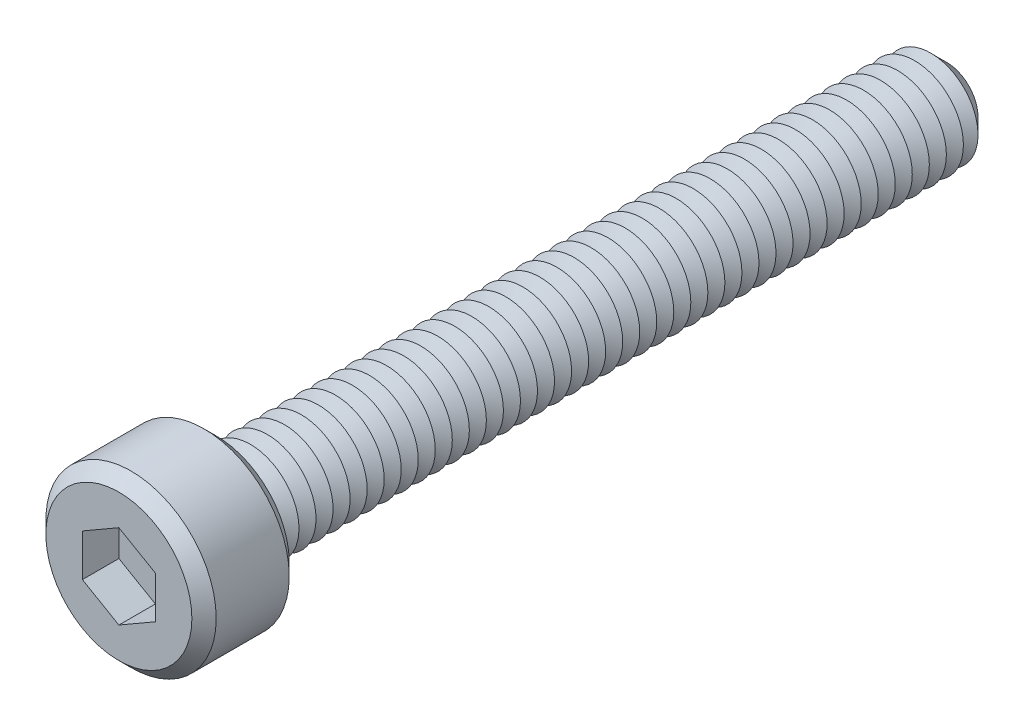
ISO-10303-21;
HEADER;
FILE_DESCRIPTION(('STEP AP214'),'2;1');
FILE_NAME('part.step','',(''),(''),'','','');
FILE_SCHEMA(('AUTOMOTIVE_DESIGN { 1 0 10303 214 1 1 1 1 }'));
ENDSEC;
DATA;
#1=APPLICATION_CONTEXT('core data for automotive mechanical design processes');
#2=APPLICATION_PROTOCOL_DEFINITION('international standard','automotive_design',2000,#1);
#3=PRODUCT_CONTEXT('',#1,'mechanical');
#4=PRODUCT('Part','Part','',(#3));
#5=PRODUCT_RELATED_PRODUCT_CATEGORY('part','',(#4));
#6=PRODUCT_DEFINITION_FORMATION('','',#4);
#7=PRODUCT_DEFINITION_CONTEXT('part definition',#1,'design');
#8=PRODUCT_DEFINITION('design','',#6,#7);
#9=PRODUCT_DEFINITION_SHAPE('','',#8);
#10=(LENGTH_UNIT() NAMED_UNIT(*) SI_UNIT(.MILLI.,.METRE.));
#11=(NAMED_UNIT(*) PLANE_ANGLE_UNIT() SI_UNIT($,.RADIAN.));
#12=(NAMED_UNIT(*) SI_UNIT($,.STERADIAN.) SOLID_ANGLE_UNIT());
#13=UNCERTAINTY_MEASURE_WITH_UNIT(LENGTH_MEASURE(1.E-05),#10,'distance_accuracy_value','');
#14=(GEOMETRIC_REPRESENTATION_CONTEXT(3) GLOBAL_UNCERTAINTY_ASSIGNED_CONTEXT((#13)) GLOBAL_UNIT_ASSIGNED_CONTEXT((#10,
#11,#12)) REPRESENTATION_CONTEXT('',''));
#15=CARTESIAN_POINT('',(0.,0.,0.));
#16=DIRECTION('',(0.,0.,1.));
#17=DIRECTION('',(1.,0.,0.));
#18=AXIS2_PLACEMENT_3D('',#15,#16,#17);
#19=CARTESIAN_POINT('',(0.,0.,4.));
#20=DIRECTION('',(0.,0.,-1.));
#21=DIRECTION('',(-1.,0.,0.));
#22=AXIS2_PLACEMENT_3D('',#19,#20,#21);
#23=CYLINDRICAL_SURFACE('',#22,3.5);
#24=CARTESIAN_POINT('',(0.,0.,0.500000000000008));
#25=DIRECTION('',(0.,0.,1.));
#26=DIRECTION('',(1.,0.,0.));
#27=AXIS2_PLACEMENT_3D('',#24,#25,#26);
#28=CIRCLE('',#27,3.5);
#29=CARTESIAN_POINT('',(3.5,0.,0.500000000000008));
#30=VERTEX_POINT('',#29);
#31=EDGE_CURVE('E512',#30,#30,#28,.T.);
#32=ORIENTED_EDGE('',*,*,#31,.T.);
#33=EDGE_LOOP('',(#32));
#34=FACE_BOUND('',#33,.T.);
#35=CARTESIAN_POINT('',(0.,0.,3.5));
#36=DIRECTION('',(0.,0.,1.));
#37=DIRECTION('',(1.,0.,0.));
#38=AXIS2_PLACEMENT_3D('',#35,#36,#37);
#39=CIRCLE('',#38,3.5);
#40=CARTESIAN_POINT('',(3.5,0.,3.5));
#41=VERTEX_POINT('',#40);
#42=EDGE_CURVE('E505',#41,#41,#39,.F.);
#43=ORIENTED_EDGE('',*,*,#42,.T.);
#44=EDGE_LOOP('',(#43));
#45=FACE_BOUND('',#44,.T.);
#46=ADVANCED_FACE('F39',(#34,#45),#23,.T.);
#47=CARTESIAN_POINT('',(0.,0.,4.));
#48=DIRECTION('',(0.,0.,1.));
#49=DIRECTION('',(1.,0.,0.));
#50=AXIS2_PLACEMENT_3D('',#47,#48,#49);
#51=PLANE('',#50);
#52=CARTESIAN_POINT('',(0.,0.,4.));
#53=DIRECTION('',(0.,0.,1.));
#54=DIRECTION('',(1.,0.,0.));
#55=AXIS2_PLACEMENT_3D('',#52,#53,#54);
#56=CIRCLE('',#55,3.00000000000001);
#57=CARTESIAN_POINT('',(3.00000000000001,0.,4.));
#58=VERTEX_POINT('',#57);
#59=EDGE_CURVE('E11',#58,#58,#56,.T.);
#60=ORIENTED_EDGE('',*,*,#59,.T.);
#61=EDGE_LOOP('',(#60));
#62=FACE_BOUND('',#61,.T.);
#63=DIRECTION('',(-0.866025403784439,0.5,0.));
#64=VECTOR('',#63,1.);
#65=CARTESIAN_POINT('',(1.5,0.866025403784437,4.));
#66=LINE('',#65,#64);
#67=CARTESIAN_POINT('',(1.5,0.866025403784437,4.));
#68=VERTEX_POINT('',#67);
#69=CARTESIAN_POINT('',(0.,1.73205080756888,4.));
#70=VERTEX_POINT('',#69);
#71=EDGE_CURVE('E55',#68,#70,#66,.T.);
#72=ORIENTED_EDGE('',*,*,#71,.F.);
#73=DIRECTION('',(0.,1.,0.));
#74=VECTOR('',#73,1.);
#75=CARTESIAN_POINT('',(1.5,-0.866025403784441,4.));
#76=LINE('',#75,#74);
#77=CARTESIAN_POINT('',(1.5,-0.866025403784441,4.));
#78=VERTEX_POINT('',#77);
#79=EDGE_CURVE('E150',#78,#68,#76,.T.);
#80=ORIENTED_EDGE('',*,*,#79,.F.);
#81=DIRECTION('',(0.866025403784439,0.5,0.));
#82=VECTOR('',#81,1.);
#83=CARTESIAN_POINT('',(0.,-1.73205080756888,4.));
#84=LINE('',#83,#82);
#85=CARTESIAN_POINT('',(0.,-1.73205080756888,4.));
#86=VERTEX_POINT('',#85);
#87=EDGE_CURVE('E147',#86,#78,#84,.T.);
#88=ORIENTED_EDGE('',*,*,#87,.F.);
#89=DIRECTION('',(0.866025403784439,-0.5,0.));
#90=VECTOR('',#89,1.);
#91=CARTESIAN_POINT('',(-1.5,-0.86602540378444,4.));
#92=LINE('',#91,#90);
#93=CARTESIAN_POINT('',(-1.5,-0.86602540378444,4.));
#94=VERTEX_POINT('',#93);
#95=EDGE_CURVE('E103',#94,#86,#92,.T.);
#96=ORIENTED_EDGE('',*,*,#95,.F.);
#97=DIRECTION('',(0.,-1.,0.));
#98=VECTOR('',#97,1.);
#99=CARTESIAN_POINT('',(-1.5,0.866025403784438,4.));
#100=LINE('',#99,#98);
#101=CARTESIAN_POINT('',(-1.5,0.866025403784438,4.));
#102=VERTEX_POINT('',#101);
#103=EDGE_CURVE('E141',#102,#94,#100,.T.);
#104=ORIENTED_EDGE('',*,*,#103,.F.);
#105=DIRECTION('',(-0.866025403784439,-0.5,0.));
#106=VECTOR('',#105,1.);
#107=CARTESIAN_POINT('',(0.,1.73205080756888,4.));
#108=LINE('',#107,#106);
#109=EDGE_CURVE('E136',#70,#102,#108,.T.);
#110=ORIENTED_EDGE('',*,*,#109,.F.);
#111=EDGE_LOOP('',(#72,#80,#88,#96,#104,#110));
#112=FACE_BOUND('',#111,.T.);
#113=ADVANCED_FACE('F530',(#62,#112),#51,.T.);
#114=CARTESIAN_POINT('',(0.,0.,0.));
#115=DIRECTION('',(0.,0.,1.));
#116=DIRECTION('',(1.,0.,0.));
#117=AXIS2_PLACEMENT_3D('',#114,#115,#116);
#118=PLANE('',#117);
#119=CARTESIAN_POINT('',(0.,0.,0.));
#120=DIRECTION('',(0.,0.,1.));
#121=DIRECTION('',(1.,0.,0.));
#122=AXIS2_PLACEMENT_3D('',#119,#120,#121);
#123=CIRCLE('',#122,2.99999999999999);
#124=CARTESIAN_POINT('',(2.99999999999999,0.,0.));
#125=VERTEX_POINT('',#124);
#126=EDGE_CURVE('E48',#125,#125,#123,.F.);
#127=ORIENTED_EDGE('',*,*,#126,.T.);
#128=EDGE_LOOP('',(#127));
#129=FACE_BOUND('',#128,.T.);
#130=CARTESIAN_POINT('',(0.,0.,0.));
#131=DIRECTION('',(0.,0.,1.));
#132=DIRECTION('',(1.,0.,0.));
#133=AXIS2_PLACEMENT_3D('',#130,#131,#132);
#134=CIRCLE('',#133,2.);
#135=CARTESIAN_POINT('',(2.,0.,0.));
#136=VERTEX_POINT('',#135);
#137=EDGE_CURVE('E497',#136,#136,#134,.T.);
#138=ORIENTED_EDGE('',*,*,#137,.T.);
#139=EDGE_LOOP('',(#138));
#140=FACE_BOUND('',#139,.T.);
#141=ADVANCED_FACE('F519',(#129,#140),#118,.F.);
#142=CARTESIAN_POINT('',(0.,0.,0.));
#143=DIRECTION('',(0.,0.,1.));
#144=DIRECTION('',(1.,0.,0.));
#145=AXIS2_PLACEMENT_3D('',#142,#143,#144);
#146=CONICAL_SURFACE('',#145,2.,1.0471975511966);
#147=CARTESIAN_POINT('',(0.,0.,-0.35));
#148=DIRECTION('',(0.,0.,1.));
#149=DIRECTION('',(1.,0.,0.));
#150=AXIS2_PLACEMENT_3D('',#147,#148,#149);
#151=CIRCLE('',#150,1.39378221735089);
#152=CARTESIAN_POINT('',(1.39378221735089,0.,-0.35));
#153=VERTEX_POINT('',#152);
#154=EDGE_CURVE('E493',#153,#153,#151,.T.);
#155=ORIENTED_EDGE('',*,*,#154,.T.);
#156=EDGE_LOOP('',(#155));
#157=FACE_BOUND('',#156,.T.);
#158=ORIENTED_EDGE('',*,*,#137,.F.);
#159=EDGE_LOOP('',(#158));
#160=FACE_BOUND('',#159,.T.);
#161=ADVANCED_FACE('F916',(#157,#160),#146,.T.);
#162=CARTESIAN_POINT('',(0.,0.,-0.35));
#163=DIRECTION('',(0.,0.,-1.));
#164=DIRECTION('',(-1.,0.,0.));
#165=AXIS2_PLACEMENT_3D('',#162,#163,#164);
#166=CONICAL_SURFACE('',#165,1.39378221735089,1.0471975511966);
#167=CARTESIAN_POINT('',(0.,0.,-0.7));
#168=DIRECTION('',(0.,0.,1.));
#169=DIRECTION('',(1.,0.,0.));
#170=AXIS2_PLACEMENT_3D('',#167,#168,#169);
#171=CIRCLE('',#170,2.);
#172=CARTESIAN_POINT('',(2.,0.,-0.7));
#173=VERTEX_POINT('',#172);
#174=EDGE_CURVE('E489',#173,#173,#171,.T.);
#175=ORIENTED_EDGE('',*,*,#174,.T.);
#176=EDGE_LOOP('',(#175));
#177=FACE_BOUND('',#176,.T.);
#178=ORIENTED_EDGE('',*,*,#154,.F.);
#179=EDGE_LOOP('',(#178));
#180=FACE_BOUND('',#179,.T.);
#181=ADVANCED_FACE('F912',(#177,#180),#166,.T.);
#182=CARTESIAN_POINT('',(0.,0.,-0.7));
#183=DIRECTION('',(0.,0.,1.));
#184=DIRECTION('',(1.,0.,0.));
#185=AXIS2_PLACEMENT_3D('',#182,#183,#184);
#186=CONICAL_SURFACE('',#185,2.,1.0471975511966);
#187=CARTESIAN_POINT('',(0.,0.,-1.05));
#188=DIRECTION('',(0.,0.,1.));
#189=DIRECTION('',(1.,0.,0.));
#190=AXIS2_PLACEMENT_3D('',#187,#188,#189);
#191=CIRCLE('',#190,1.39378221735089);
#192=CARTESIAN_POINT('',(1.39378221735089,0.,-1.05));
#193=VERTEX_POINT('',#192);
#194=EDGE_CURVE('E485',#193,#193,#191,.T.);
#195=ORIENTED_EDGE('',*,*,#194,.T.);
#196=EDGE_LOOP('',(#195));
#197=FACE_BOUND('',#196,.T.);
#198=ORIENTED_EDGE('',*,*,#174,.F.);
#199=EDGE_LOOP('',(#198));
#200=FACE_BOUND('',#199,.T.);
#201=ADVANCED_FACE('F908',(#197,#200),#186,.T.);
#202=CARTESIAN_POINT('',(0.,0.,-1.05));
#203=DIRECTION('',(0.,0.,-1.));
#204=DIRECTION('',(-1.,0.,0.));
#205=AXIS2_PLACEMENT_3D('',#202,#203,#204);
#206=CONICAL_SURFACE('',#205,1.39378221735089,1.0471975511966);
#207=CARTESIAN_POINT('',(0.,0.,-1.4));
#208=DIRECTION('',(0.,0.,1.));
#209=DIRECTION('',(1.,0.,0.));
#210=AXIS2_PLACEMENT_3D('',#207,#208,#209);
#211=CIRCLE('',#210,2.);
#212=CARTESIAN_POINT('',(2.,0.,-1.4));
#213=VERTEX_POINT('',#212);
#214=EDGE_CURVE('E481',#213,#213,#211,.T.);
#215=ORIENTED_EDGE('',*,*,#214,.T.);
#216=EDGE_LOOP('',(#215));
#217=FACE_BOUND('',#216,.T.);
#218=ORIENTED_EDGE('',*,*,#194,.F.);
#219=EDGE_LOOP('',(#218));
#220=FACE_BOUND('',#219,.T.);
#221=ADVANCED_FACE('F904',(#217,#220),#206,.T.);
#222=CARTESIAN_POINT('',(0.,0.,-1.4));
#223=DIRECTION('',(0.,0.,1.));
#224=DIRECTION('',(1.,0.,0.));
#225=AXIS2_PLACEMENT_3D('',#222,#223,#224);
#226=CONICAL_SURFACE('',#225,2.,1.0471975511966);
#227=CARTESIAN_POINT('',(0.,0.,-1.75));
#228=DIRECTION('',(0.,0.,1.));
#229=DIRECTION('',(1.,0.,0.));
#230=AXIS2_PLACEMENT_3D('',#227,#228,#229);
#231=CIRCLE('',#230,1.39378221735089);
#232=CARTESIAN_POINT('',(1.39378221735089,0.,-1.75));
#233=VERTEX_POINT('',#232);
#234=EDGE_CURVE('E477',#233,#233,#231,.T.);
#235=ORIENTED_EDGE('',*,*,#234,.T.);
#236=EDGE_LOOP('',(#235));
#237=FACE_BOUND('',#236,.T.);
#238=ORIENTED_EDGE('',*,*,#214,.F.);
#239=EDGE_LOOP('',(#238));
#240=FACE_BOUND('',#239,.T.);
#241=ADVANCED_FACE('F900',(#237,#240),#226,.T.);
#242=CARTESIAN_POINT('',(0.,0.,-1.75));
#243=DIRECTION('',(0.,0.,-1.));
#244=DIRECTION('',(-1.,0.,0.));
#245=AXIS2_PLACEMENT_3D('',#242,#243,#244);
#246=CONICAL_SURFACE('',#245,1.39378221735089,1.0471975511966);
#247=CARTESIAN_POINT('',(0.,0.,-2.1));
#248=DIRECTION('',(0.,0.,1.));
#249=DIRECTION('',(1.,0.,0.));
#250=AXIS2_PLACEMENT_3D('',#247,#248,#249);
#251=CIRCLE('',#250,2.);
#252=CARTESIAN_POINT('',(2.,0.,-2.1));
#253=VERTEX_POINT('',#252);
#254=EDGE_CURVE('E473',#253,#253,#251,.T.);
#255=ORIENTED_EDGE('',*,*,#254,.T.);
#256=EDGE_LOOP('',(#255));
#257=FACE_BOUND('',#256,.T.);
#258=ORIENTED_EDGE('',*,*,#234,.F.);
#259=EDGE_LOOP('',(#258));
#260=FACE_BOUND('',#259,.T.);
#261=ADVANCED_FACE('F896',(#257,#260),#246,.T.);
#262=CARTESIAN_POINT('',(0.,0.,-2.1));
#263=DIRECTION('',(0.,0.,1.));
#264=DIRECTION('',(1.,0.,0.));
#265=AXIS2_PLACEMENT_3D('',#262,#263,#264);
#266=CONICAL_SURFACE('',#265,2.,1.0471975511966);
#267=CARTESIAN_POINT('',(0.,0.,-2.45));
#268=DIRECTION('',(0.,0.,1.));
#269=DIRECTION('',(1.,0.,0.));
#270=AXIS2_PLACEMENT_3D('',#267,#268,#269);
#271=CIRCLE('',#270,1.39378221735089);
#272=CARTESIAN_POINT('',(1.39378221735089,0.,-2.45));
#273=VERTEX_POINT('',#272);
#274=EDGE_CURVE('E469',#273,#273,#271,.T.);
#275=ORIENTED_EDGE('',*,*,#274,.T.);
#276=EDGE_LOOP('',(#275));
#277=FACE_BOUND('',#276,.T.);
#278=ORIENTED_EDGE('',*,*,#254,.F.);
#279=EDGE_LOOP('',(#278));
#280=FACE_BOUND('',#279,.T.);
#281=ADVANCED_FACE('F892',(#277,#280),#266,.T.);
#282=CARTESIAN_POINT('',(0.,0.,-2.45));
#283=DIRECTION('',(0.,0.,-1.));
#284=DIRECTION('',(-1.,0.,0.));
#285=AXIS2_PLACEMENT_3D('',#282,#283,#284);
#286=CONICAL_SURFACE('',#285,1.39378221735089,1.0471975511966);
#287=CARTESIAN_POINT('',(0.,0.,-2.8));
#288=DIRECTION('',(0.,0.,1.));
#289=DIRECTION('',(1.,0.,0.));
#290=AXIS2_PLACEMENT_3D('',#287,#288,#289);
#291=CIRCLE('',#290,2.);
#292=CARTESIAN_POINT('',(2.,0.,-2.8));
#293=VERTEX_POINT('',#292);
#294=EDGE_CURVE('E465',#293,#293,#291,.T.);
#295=ORIENTED_EDGE('',*,*,#294,.T.);
#296=EDGE_LOOP('',(#295));
#297=FACE_BOUND('',#296,.T.);
#298=ORIENTED_EDGE('',*,*,#274,.F.);
#299=EDGE_LOOP('',(#298));
#300=FACE_BOUND('',#299,.T.);
#301=ADVANCED_FACE('F888',(#297,#300),#286,.T.);
#302=CARTESIAN_POINT('',(0.,0.,-2.8));
#303=DIRECTION('',(0.,0.,1.));
#304=DIRECTION('',(1.,0.,0.));
#305=AXIS2_PLACEMENT_3D('',#302,#303,#304);
#306=CONICAL_SURFACE('',#305,2.,1.0471975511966);
#307=CARTESIAN_POINT('',(0.,0.,-3.15));
#308=DIRECTION('',(0.,0.,1.));
#309=DIRECTION('',(1.,0.,0.));
#310=AXIS2_PLACEMENT_3D('',#307,#308,#309);
#311=CIRCLE('',#310,1.39378221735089);
#312=CARTESIAN_POINT('',(1.39378221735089,0.,-3.15));
#313=VERTEX_POINT('',#312);
#314=EDGE_CURVE('E461',#313,#313,#311,.T.);
#315=ORIENTED_EDGE('',*,*,#314,.T.);
#316=EDGE_LOOP('',(#315));
#317=FACE_BOUND('',#316,.T.);
#318=ORIENTED_EDGE('',*,*,#294,.F.);
#319=EDGE_LOOP('',(#318));
#320=FACE_BOUND('',#319,.T.);
#321=ADVANCED_FACE('F884',(#317,#320),#306,.T.);
#322=CARTESIAN_POINT('',(0.,0.,-3.15));
#323=DIRECTION('',(0.,0.,-1.));
#324=DIRECTION('',(-1.,0.,0.));
#325=AXIS2_PLACEMENT_3D('',#322,#323,#324);
#326=CONICAL_SURFACE('',#325,1.39378221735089,1.0471975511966);
#327=CARTESIAN_POINT('',(0.,0.,-3.5));
#328=DIRECTION('',(0.,0.,1.));
#329=DIRECTION('',(1.,0.,0.));
#330=AXIS2_PLACEMENT_3D('',#327,#328,#329);
#331=CIRCLE('',#330,2.);
#332=CARTESIAN_POINT('',(2.,0.,-3.5));
#333=VERTEX_POINT('',#332);
#334=EDGE_CURVE('E457',#333,#333,#331,.T.);
#335=ORIENTED_EDGE('',*,*,#334,.T.);
#336=EDGE_LOOP('',(#335));
#337=FACE_BOUND('',#336,.T.);
#338=ORIENTED_EDGE('',*,*,#314,.F.);
#339=EDGE_LOOP('',(#338));
#340=FACE_BOUND('',#339,.T.);
#341=ADVANCED_FACE('F880',(#337,#340),#326,.T.);
#342=CARTESIAN_POINT('',(0.,0.,-3.5));
#343=DIRECTION('',(0.,0.,1.));
#344=DIRECTION('',(1.,0.,0.));
#345=AXIS2_PLACEMENT_3D('',#342,#343,#344);
#346=CONICAL_SURFACE('',#345,2.,1.0471975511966);
#347=CARTESIAN_POINT('',(0.,0.,-3.85));
#348=DIRECTION('',(0.,0.,1.));
#349=DIRECTION('',(1.,0.,0.));
#350=AXIS2_PLACEMENT_3D('',#347,#348,#349);
#351=CIRCLE('',#350,1.39378221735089);
#352=CARTESIAN_POINT('',(1.39378221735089,0.,-3.85));
#353=VERTEX_POINT('',#352);
#354=EDGE_CURVE('E453',#353,#353,#351,.T.);
#355=ORIENTED_EDGE('',*,*,#354,.T.);
#356=EDGE_LOOP('',(#355));
#357=FACE_BOUND('',#356,.T.);
#358=ORIENTED_EDGE('',*,*,#334,.F.);
#359=EDGE_LOOP('',(#358));
#360=FACE_BOUND('',#359,.T.);
#361=ADVANCED_FACE('F876',(#357,#360),#346,.T.);
#362=CARTESIAN_POINT('',(0.,0.,-3.85));
#363=DIRECTION('',(0.,0.,-1.));
#364=DIRECTION('',(-1.,0.,0.));
#365=AXIS2_PLACEMENT_3D('',#362,#363,#364);
#366=CONICAL_SURFACE('',#365,1.39378221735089,1.0471975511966);
#367=CARTESIAN_POINT('',(0.,0.,-4.2));
#368=DIRECTION('',(0.,0.,1.));
#369=DIRECTION('',(1.,0.,0.));
#370=AXIS2_PLACEMENT_3D('',#367,#368,#369);
#371=CIRCLE('',#370,2.);
#372=CARTESIAN_POINT('',(2.,0.,-4.2));
#373=VERTEX_POINT('',#372);
#374=EDGE_CURVE('E449',#373,#373,#371,.T.);
#375=ORIENTED_EDGE('',*,*,#374,.T.);
#376=EDGE_LOOP('',(#375));
#377=FACE_BOUND('',#376,.T.);
#378=ORIENTED_EDGE('',*,*,#354,.F.);
#379=EDGE_LOOP('',(#378));
#380=FACE_BOUND('',#379,.T.);
#381=ADVANCED_FACE('F872',(#377,#380),#366,.T.);
#382=CARTESIAN_POINT('',(0.,0.,-4.2));
#383=DIRECTION('',(0.,0.,1.));
#384=DIRECTION('',(1.,0.,0.));
#385=AXIS2_PLACEMENT_3D('',#382,#383,#384);
#386=CONICAL_SURFACE('',#385,2.,1.0471975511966);
#387=CARTESIAN_POINT('',(0.,0.,-4.55));
#388=DIRECTION('',(0.,0.,1.));
#389=DIRECTION('',(1.,0.,0.));
#390=AXIS2_PLACEMENT_3D('',#387,#388,#389);
#391=CIRCLE('',#390,1.39378221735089);
#392=CARTESIAN_POINT('',(1.39378221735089,0.,-4.55));
#393=VERTEX_POINT('',#392);
#394=EDGE_CURVE('E445',#393,#393,#391,.T.);
#395=ORIENTED_EDGE('',*,*,#394,.T.);
#396=EDGE_LOOP('',(#395));
#397=FACE_BOUND('',#396,.T.);
#398=ORIENTED_EDGE('',*,*,#374,.F.);
#399=EDGE_LOOP('',(#398));
#400=FACE_BOUND('',#399,.T.);
#401=ADVANCED_FACE('F868',(#397,#400),#386,.T.);
#402=CARTESIAN_POINT('',(0.,0.,-4.55));
#403=DIRECTION('',(0.,0.,-1.));
#404=DIRECTION('',(-1.,0.,0.));
#405=AXIS2_PLACEMENT_3D('',#402,#403,#404);
#406=CONICAL_SURFACE('',#405,1.39378221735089,1.0471975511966);
#407=CARTESIAN_POINT('',(0.,0.,-4.9));
#408=DIRECTION('',(0.,0.,1.));
#409=DIRECTION('',(1.,0.,0.));
#410=AXIS2_PLACEMENT_3D('',#407,#408,#409);
#411=CIRCLE('',#410,2.);
#412=CARTESIAN_POINT('',(2.,0.,-4.9));
#413=VERTEX_POINT('',#412);
#414=EDGE_CURVE('E441',#413,#413,#411,.T.);
#415=ORIENTED_EDGE('',*,*,#414,.T.);
#416=EDGE_LOOP('',(#415));
#417=FACE_BOUND('',#416,.T.);
#418=ORIENTED_EDGE('',*,*,#394,.F.);
#419=EDGE_LOOP('',(#418));
#420=FACE_BOUND('',#419,.T.);
#421=ADVANCED_FACE('F864',(#417,#420),#406,.T.);
#422=CARTESIAN_POINT('',(0.,0.,-4.9));
#423=DIRECTION('',(0.,0.,1.));
#424=DIRECTION('',(1.,0.,0.));
#425=AXIS2_PLACEMENT_3D('',#422,#423,#424);
#426=CONICAL_SURFACE('',#425,2.,1.0471975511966);
#427=CARTESIAN_POINT('',(0.,0.,-5.25));
#428=DIRECTION('',(0.,0.,1.));
#429=DIRECTION('',(1.,0.,0.));
#430=AXIS2_PLACEMENT_3D('',#427,#428,#429);
#431=CIRCLE('',#430,1.39378221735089);
#432=CARTESIAN_POINT('',(1.39378221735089,0.,-5.25));
#433=VERTEX_POINT('',#432);
#434=EDGE_CURVE('E437',#433,#433,#431,.T.);
#435=ORIENTED_EDGE('',*,*,#434,.T.);
#436=EDGE_LOOP('',(#435));
#437=FACE_BOUND('',#436,.T.);
#438=ORIENTED_EDGE('',*,*,#414,.F.);
#439=EDGE_LOOP('',(#438));
#440=FACE_BOUND('',#439,.T.);
#441=ADVANCED_FACE('F860',(#437,#440),#426,.T.);
#442=CARTESIAN_POINT('',(0.,0.,-5.25));
#443=DIRECTION('',(0.,0.,-1.));
#444=DIRECTION('',(-1.,0.,0.));
#445=AXIS2_PLACEMENT_3D('',#442,#443,#444);
#446=CONICAL_SURFACE('',#445,1.39378221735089,1.0471975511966);
#447=CARTESIAN_POINT('',(0.,0.,-5.6));
#448=DIRECTION('',(0.,0.,1.));
#449=DIRECTION('',(1.,0.,0.));
#450=AXIS2_PLACEMENT_3D('',#447,#448,#449);
#451=CIRCLE('',#450,2.);
#452=CARTESIAN_POINT('',(2.,0.,-5.6));
#453=VERTEX_POINT('',#452);
#454=EDGE_CURVE('E433',#453,#453,#451,.T.);
#455=ORIENTED_EDGE('',*,*,#454,.T.);
#456=EDGE_LOOP('',(#455));
#457=FACE_BOUND('',#456,.T.);
#458=ORIENTED_EDGE('',*,*,#434,.F.);
#459=EDGE_LOOP('',(#458));
#460=FACE_BOUND('',#459,.T.);
#461=ADVANCED_FACE('F856',(#457,#460),#446,.T.);
#462=CARTESIAN_POINT('',(0.,0.,-5.6));
#463=DIRECTION('',(0.,0.,1.));
#464=DIRECTION('',(1.,0.,0.));
#465=AXIS2_PLACEMENT_3D('',#462,#463,#464);
#466=CONICAL_SURFACE('',#465,2.,1.0471975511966);
#467=CARTESIAN_POINT('',(0.,0.,-5.95));
#468=DIRECTION('',(0.,0.,1.));
#469=DIRECTION('',(1.,0.,0.));
#470=AXIS2_PLACEMENT_3D('',#467,#468,#469);
#471=CIRCLE('',#470,1.39378221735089);
#472=CARTESIAN_POINT('',(1.39378221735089,0.,-5.95));
#473=VERTEX_POINT('',#472);
#474=EDGE_CURVE('E429',#473,#473,#471,.T.);
#475=ORIENTED_EDGE('',*,*,#474,.T.);
#476=EDGE_LOOP('',(#475));
#477=FACE_BOUND('',#476,.T.);
#478=ORIENTED_EDGE('',*,*,#454,.F.);
#479=EDGE_LOOP('',(#478));
#480=FACE_BOUND('',#479,.T.);
#481=ADVANCED_FACE('F852',(#477,#480),#466,.T.);
#482=CARTESIAN_POINT('',(0.,0.,-5.95));
#483=DIRECTION('',(0.,0.,-1.));
#484=DIRECTION('',(-1.,0.,0.));
#485=AXIS2_PLACEMENT_3D('',#482,#483,#484);
#486=CONICAL_SURFACE('',#485,1.39378221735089,1.0471975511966);
#487=CARTESIAN_POINT('',(0.,0.,-6.3));
#488=DIRECTION('',(0.,0.,1.));
#489=DIRECTION('',(1.,0.,0.));
#490=AXIS2_PLACEMENT_3D('',#487,#488,#489);
#491=CIRCLE('',#490,2.);
#492=CARTESIAN_POINT('',(2.,0.,-6.3));
#493=VERTEX_POINT('',#492);
#494=EDGE_CURVE('E425',#493,#493,#491,.T.);
#495=ORIENTED_EDGE('',*,*,#494,.T.);
#496=EDGE_LOOP('',(#495));
#497=FACE_BOUND('',#496,.T.);
#498=ORIENTED_EDGE('',*,*,#474,.F.);
#499=EDGE_LOOP('',(#498));
#500=FACE_BOUND('',#499,.T.);
#501=ADVANCED_FACE('F848',(#497,#500),#486,.T.);
#502=CARTESIAN_POINT('',(0.,0.,-6.3));
#503=DIRECTION('',(0.,0.,1.));
#504=DIRECTION('',(1.,0.,0.));
#505=AXIS2_PLACEMENT_3D('',#502,#503,#504);
#506=CONICAL_SURFACE('',#505,2.,1.0471975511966);
#507=CARTESIAN_POINT('',(0.,0.,-6.65));
#508=DIRECTION('',(0.,0.,1.));
#509=DIRECTION('',(1.,0.,0.));
#510=AXIS2_PLACEMENT_3D('',#507,#508,#509);
#511=CIRCLE('',#510,1.39378221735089);
#512=CARTESIAN_POINT('',(1.39378221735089,0.,-6.65));
#513=VERTEX_POINT('',#512);
#514=EDGE_CURVE('E421',#513,#513,#511,.T.);
#515=ORIENTED_EDGE('',*,*,#514,.T.);
#516=EDGE_LOOP('',(#515));
#517=FACE_BOUND('',#516,.T.);
#518=ORIENTED_EDGE('',*,*,#494,.F.);
#519=EDGE_LOOP('',(#518));
#520=FACE_BOUND('',#519,.T.);
#521=ADVANCED_FACE('F844',(#517,#520),#506,.T.);
#522=CARTESIAN_POINT('',(0.,0.,-6.65));
#523=DIRECTION('',(0.,0.,-1.));
#524=DIRECTION('',(-1.,0.,0.));
#525=AXIS2_PLACEMENT_3D('',#522,#523,#524);
#526=CONICAL_SURFACE('',#525,1.39378221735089,1.0471975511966);
#527=CARTESIAN_POINT('',(0.,0.,-7.));
#528=DIRECTION('',(0.,0.,1.));
#529=DIRECTION('',(1.,0.,0.));
#530=AXIS2_PLACEMENT_3D('',#527,#528,#529);
#531=CIRCLE('',#530,2.);
#532=CARTESIAN_POINT('',(2.,0.,-7.));
#533=VERTEX_POINT('',#532);
#534=EDGE_CURVE('E417',#533,#533,#531,.T.);
#535=ORIENTED_EDGE('',*,*,#534,.T.);
#536=EDGE_LOOP('',(#535));
#537=FACE_BOUND('',#536,.T.);
#538=ORIENTED_EDGE('',*,*,#514,.F.);
#539=EDGE_LOOP('',(#538));
#540=FACE_BOUND('',#539,.T.);
#541=ADVANCED_FACE('F840',(#537,#540),#526,.T.);
#542=CARTESIAN_POINT('',(0.,0.,-7.));
#543=DIRECTION('',(0.,0.,1.));
#544=DIRECTION('',(1.,0.,0.));
#545=AXIS2_PLACEMENT_3D('',#542,#543,#544);
#546=CONICAL_SURFACE('',#545,2.,1.0471975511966);
#547=CARTESIAN_POINT('',(0.,0.,-7.35));
#548=DIRECTION('',(0.,0.,1.));
#549=DIRECTION('',(1.,0.,0.));
#550=AXIS2_PLACEMENT_3D('',#547,#548,#549);
#551=CIRCLE('',#550,1.39378221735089);
#552=CARTESIAN_POINT('',(1.39378221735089,0.,-7.35));
#553=VERTEX_POINT('',#552);
#554=EDGE_CURVE('E413',#553,#553,#551,.T.);
#555=ORIENTED_EDGE('',*,*,#554,.T.);
#556=EDGE_LOOP('',(#555));
#557=FACE_BOUND('',#556,.T.);
#558=ORIENTED_EDGE('',*,*,#534,.F.);
#559=EDGE_LOOP('',(#558));
#560=FACE_BOUND('',#559,.T.);
#561=ADVANCED_FACE('F836',(#557,#560),#546,.T.);
#562=CARTESIAN_POINT('',(0.,0.,-7.35));
#563=DIRECTION('',(0.,0.,-1.));
#564=DIRECTION('',(-1.,0.,0.));
#565=AXIS2_PLACEMENT_3D('',#562,#563,#564);
#566=CONICAL_SURFACE('',#565,1.39378221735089,1.0471975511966);
#567=CARTESIAN_POINT('',(0.,0.,-7.7));
#568=DIRECTION('',(0.,0.,1.));
#569=DIRECTION('',(1.,0.,0.));
#570=AXIS2_PLACEMENT_3D('',#567,#568,#569);
#571=CIRCLE('',#570,2.);
#572=CARTESIAN_POINT('',(2.,0.,-7.7));
#573=VERTEX_POINT('',#572);
#574=EDGE_CURVE('E409',#573,#573,#571,.T.);
#575=ORIENTED_EDGE('',*,*,#574,.T.);
#576=EDGE_LOOP('',(#575));
#577=FACE_BOUND('',#576,.T.);
#578=ORIENTED_EDGE('',*,*,#554,.F.);
#579=EDGE_LOOP('',(#578));
#580=FACE_BOUND('',#579,.T.);
#581=ADVANCED_FACE('F832',(#577,#580),#566,.T.);
#582=CARTESIAN_POINT('',(0.,0.,-7.7));
#583=DIRECTION('',(0.,0.,1.));
#584=DIRECTION('',(1.,0.,0.));
#585=AXIS2_PLACEMENT_3D('',#582,#583,#584);
#586=CONICAL_SURFACE('',#585,2.,1.0471975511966);
#587=CARTESIAN_POINT('',(0.,0.,-8.05));
#588=DIRECTION('',(0.,0.,1.));
#589=DIRECTION('',(1.,0.,0.));
#590=AXIS2_PLACEMENT_3D('',#587,#588,#589);
#591=CIRCLE('',#590,1.39378221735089);
#592=CARTESIAN_POINT('',(1.39378221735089,0.,-8.05));
#593=VERTEX_POINT('',#592);
#594=EDGE_CURVE('E405',#593,#593,#591,.T.);
#595=ORIENTED_EDGE('',*,*,#594,.T.);
#596=EDGE_LOOP('',(#595));
#597=FACE_BOUND('',#596,.T.);
#598=ORIENTED_EDGE('',*,*,#574,.F.);
#599=EDGE_LOOP('',(#598));
#600=FACE_BOUND('',#599,.T.);
#601=ADVANCED_FACE('F828',(#597,#600),#586,.T.);
#602=CARTESIAN_POINT('',(0.,0.,-8.05));
#603=DIRECTION('',(0.,0.,-1.));
#604=DIRECTION('',(-1.,0.,0.));
#605=AXIS2_PLACEMENT_3D('',#602,#603,#604);
#606=CONICAL_SURFACE('',#605,1.39378221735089,1.0471975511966);
#607=CARTESIAN_POINT('',(0.,0.,-8.4));
#608=DIRECTION('',(0.,0.,1.));
#609=DIRECTION('',(1.,0.,0.));
#610=AXIS2_PLACEMENT_3D('',#607,#608,#609);
#611=CIRCLE('',#610,2.);
#612=CARTESIAN_POINT('',(2.,0.,-8.4));
#613=VERTEX_POINT('',#612);
#614=EDGE_CURVE('E401',#613,#613,#611,.T.);
#615=ORIENTED_EDGE('',*,*,#614,.T.);
#616=EDGE_LOOP('',(#615));
#617=FACE_BOUND('',#616,.T.);
#618=ORIENTED_EDGE('',*,*,#594,.F.);
#619=EDGE_LOOP('',(#618));
#620=FACE_BOUND('',#619,.T.);
#621=ADVANCED_FACE('F824',(#617,#620),#606,.T.);
#622=CARTESIAN_POINT('',(0.,0.,-8.4));
#623=DIRECTION('',(0.,0.,1.));
#624=DIRECTION('',(1.,0.,0.));
#625=AXIS2_PLACEMENT_3D('',#622,#623,#624);
#626=CONICAL_SURFACE('',#625,2.,1.0471975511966);
#627=CARTESIAN_POINT('',(0.,0.,-8.75));
#628=DIRECTION('',(0.,0.,1.));
#629=DIRECTION('',(1.,0.,0.));
#630=AXIS2_PLACEMENT_3D('',#627,#628,#629);
#631=CIRCLE('',#630,1.39378221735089);
#632=CARTESIAN_POINT('',(1.39378221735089,0.,-8.75));
#633=VERTEX_POINT('',#632);
#634=EDGE_CURVE('E397',#633,#633,#631,.T.);
#635=ORIENTED_EDGE('',*,*,#634,.T.);
#636=EDGE_LOOP('',(#635));
#637=FACE_BOUND('',#636,.T.);
#638=ORIENTED_EDGE('',*,*,#614,.F.);
#639=EDGE_LOOP('',(#638));
#640=FACE_BOUND('',#639,.T.);
#641=ADVANCED_FACE('F820',(#637,#640),#626,.T.);
#642=CARTESIAN_POINT('',(0.,0.,-8.75));
#643=DIRECTION('',(0.,0.,-1.));
#644=DIRECTION('',(-1.,0.,0.));
#645=AXIS2_PLACEMENT_3D('',#642,#643,#644);
#646=CONICAL_SURFACE('',#645,1.39378221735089,1.0471975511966);
#647=CARTESIAN_POINT('',(0.,0.,-9.1));
#648=DIRECTION('',(0.,0.,1.));
#649=DIRECTION('',(1.,0.,0.));
#650=AXIS2_PLACEMENT_3D('',#647,#648,#649);
#651=CIRCLE('',#650,2.);
#652=CARTESIAN_POINT('',(2.,0.,-9.1));
#653=VERTEX_POINT('',#652);
#654=EDGE_CURVE('E393',#653,#653,#651,.T.);
#655=ORIENTED_EDGE('',*,*,#654,.T.);
#656=EDGE_LOOP('',(#655));
#657=FACE_BOUND('',#656,.T.);
#658=ORIENTED_EDGE('',*,*,#634,.F.);
#659=EDGE_LOOP('',(#658));
#660=FACE_BOUND('',#659,.T.);
#661=ADVANCED_FACE('F816',(#657,#660),#646,.T.);
#662=CARTESIAN_POINT('',(0.,0.,-9.1));
#663=DIRECTION('',(0.,0.,1.));
#664=DIRECTION('',(1.,0.,0.));
#665=AXIS2_PLACEMENT_3D('',#662,#663,#664);
#666=CONICAL_SURFACE('',#665,2.,1.0471975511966);
#667=CARTESIAN_POINT('',(0.,0.,-9.45));
#668=DIRECTION('',(0.,0.,1.));
#669=DIRECTION('',(1.,0.,0.));
#670=AXIS2_PLACEMENT_3D('',#667,#668,#669);
#671=CIRCLE('',#670,1.39378221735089);
#672=CARTESIAN_POINT('',(1.39378221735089,0.,-9.45));
#673=VERTEX_POINT('',#672);
#674=EDGE_CURVE('E389',#673,#673,#671,.T.);
#675=ORIENTED_EDGE('',*,*,#674,.T.);
#676=EDGE_LOOP('',(#675));
#677=FACE_BOUND('',#676,.T.);
#678=ORIENTED_EDGE('',*,*,#654,.F.);
#679=EDGE_LOOP('',(#678));
#680=FACE_BOUND('',#679,.T.);
#681=ADVANCED_FACE('F812',(#677,#680),#666,.T.);
#682=CARTESIAN_POINT('',(0.,0.,-9.45));
#683=DIRECTION('',(0.,0.,-1.));
#684=DIRECTION('',(-1.,0.,0.));
#685=AXIS2_PLACEMENT_3D('',#682,#683,#684);
#686=CONICAL_SURFACE('',#685,1.39378221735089,1.0471975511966);
#687=CARTESIAN_POINT('',(0.,0.,-9.8));
#688=DIRECTION('',(0.,0.,1.));
#689=DIRECTION('',(1.,0.,0.));
#690=AXIS2_PLACEMENT_3D('',#687,#688,#689);
#691=CIRCLE('',#690,2.);
#692=CARTESIAN_POINT('',(2.,0.,-9.8));
#693=VERTEX_POINT('',#692);
#694=EDGE_CURVE('E385',#693,#693,#691,.T.);
#695=ORIENTED_EDGE('',*,*,#694,.T.);
#696=EDGE_LOOP('',(#695));
#697=FACE_BOUND('',#696,.T.);
#698=ORIENTED_EDGE('',*,*,#674,.F.);
#699=EDGE_LOOP('',(#698));
#700=FACE_BOUND('',#699,.T.);
#701=ADVANCED_FACE('F808',(#697,#700),#686,.T.);
#702=CARTESIAN_POINT('',(0.,0.,-9.8));
#703=DIRECTION('',(0.,0.,1.));
#704=DIRECTION('',(1.,0.,0.));
#705=AXIS2_PLACEMENT_3D('',#702,#703,#704);
#706=CONICAL_SURFACE('',#705,2.,1.0471975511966);
#707=CARTESIAN_POINT('',(0.,0.,-10.15));
#708=DIRECTION('',(0.,0.,1.));
#709=DIRECTION('',(1.,0.,0.));
#710=AXIS2_PLACEMENT_3D('',#707,#708,#709);
#711=CIRCLE('',#710,1.39378221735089);
#712=CARTESIAN_POINT('',(1.39378221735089,0.,-10.15));
#713=VERTEX_POINT('',#712);
#714=EDGE_CURVE('E381',#713,#713,#711,.T.);
#715=ORIENTED_EDGE('',*,*,#714,.T.);
#716=EDGE_LOOP('',(#715));
#717=FACE_BOUND('',#716,.T.);
#718=ORIENTED_EDGE('',*,*,#694,.F.);
#719=EDGE_LOOP('',(#718));
#720=FACE_BOUND('',#719,.T.);
#721=ADVANCED_FACE('F804',(#717,#720),#706,.T.);
#722=CARTESIAN_POINT('',(0.,0.,-10.15));
#723=DIRECTION('',(0.,0.,-1.));
#724=DIRECTION('',(-1.,0.,0.));
#725=AXIS2_PLACEMENT_3D('',#722,#723,#724);
#726=CONICAL_SURFACE('',#725,1.39378221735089,1.0471975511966);
#727=CARTESIAN_POINT('',(0.,0.,-10.5));
#728=DIRECTION('',(0.,0.,1.));
#729=DIRECTION('',(1.,0.,0.));
#730=AXIS2_PLACEMENT_3D('',#727,#728,#729);
#731=CIRCLE('',#730,2.);
#732=CARTESIAN_POINT('',(2.,0.,-10.5));
#733=VERTEX_POINT('',#732);
#734=EDGE_CURVE('E377',#733,#733,#731,.T.);
#735=ORIENTED_EDGE('',*,*,#734,.T.);
#736=EDGE_LOOP('',(#735));
#737=FACE_BOUND('',#736,.T.);
#738=ORIENTED_EDGE('',*,*,#714,.F.);
#739=EDGE_LOOP('',(#738));
#740=FACE_BOUND('',#739,.T.);
#741=ADVANCED_FACE('F800',(#737,#740),#726,.T.);
#742=CARTESIAN_POINT('',(0.,0.,-10.5));
#743=DIRECTION('',(0.,0.,1.));
#744=DIRECTION('',(1.,0.,0.));
#745=AXIS2_PLACEMENT_3D('',#742,#743,#744);
#746=CONICAL_SURFACE('',#745,2.,1.0471975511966);
#747=CARTESIAN_POINT('',(0.,0.,-10.85));
#748=DIRECTION('',(0.,0.,1.));
#749=DIRECTION('',(1.,0.,0.));
#750=AXIS2_PLACEMENT_3D('',#747,#748,#749);
#751=CIRCLE('',#750,1.39378221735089);
#752=CARTESIAN_POINT('',(1.39378221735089,0.,-10.85));
#753=VERTEX_POINT('',#752);
#754=EDGE_CURVE('E373',#753,#753,#751,.T.);
#755=ORIENTED_EDGE('',*,*,#754,.T.);
#756=EDGE_LOOP('',(#755));
#757=FACE_BOUND('',#756,.T.);
#758=ORIENTED_EDGE('',*,*,#734,.F.);
#759=EDGE_LOOP('',(#758));
#760=FACE_BOUND('',#759,.T.);
#761=ADVANCED_FACE('F796',(#757,#760),#746,.T.);
#762=CARTESIAN_POINT('',(0.,0.,-10.85));
#763=DIRECTION('',(0.,0.,-1.));
#764=DIRECTION('',(-1.,0.,0.));
#765=AXIS2_PLACEMENT_3D('',#762,#763,#764);
#766=CONICAL_SURFACE('',#765,1.39378221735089,1.0471975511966);
#767=CARTESIAN_POINT('',(0.,0.,-11.2));
#768=DIRECTION('',(0.,0.,1.));
#769=DIRECTION('',(1.,0.,0.));
#770=AXIS2_PLACEMENT_3D('',#767,#768,#769);
#771=CIRCLE('',#770,2.);
#772=CARTESIAN_POINT('',(2.,0.,-11.2));
#773=VERTEX_POINT('',#772);
#774=EDGE_CURVE('E369',#773,#773,#771,.T.);
#775=ORIENTED_EDGE('',*,*,#774,.T.);
#776=EDGE_LOOP('',(#775));
#777=FACE_BOUND('',#776,.T.);
#778=ORIENTED_EDGE('',*,*,#754,.F.);
#779=EDGE_LOOP('',(#778));
#780=FACE_BOUND('',#779,.T.);
#781=ADVANCED_FACE('F792',(#777,#780),#766,.T.);
#782=CARTESIAN_POINT('',(0.,0.,-11.2));
#783=DIRECTION('',(0.,0.,1.));
#784=DIRECTION('',(1.,0.,0.));
#785=AXIS2_PLACEMENT_3D('',#782,#783,#784);
#786=CONICAL_SURFACE('',#785,2.,1.0471975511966);
#787=CARTESIAN_POINT('',(0.,0.,-11.55));
#788=DIRECTION('',(0.,0.,1.));
#789=DIRECTION('',(1.,0.,0.));
#790=AXIS2_PLACEMENT_3D('',#787,#788,#789);
#791=CIRCLE('',#790,1.39378221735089);
#792=CARTESIAN_POINT('',(1.39378221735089,0.,-11.55));
#793=VERTEX_POINT('',#792);
#794=EDGE_CURVE('E365',#793,#793,#791,.T.);
#795=ORIENTED_EDGE('',*,*,#794,.T.);
#796=EDGE_LOOP('',(#795));
#797=FACE_BOUND('',#796,.T.);
#798=ORIENTED_EDGE('',*,*,#774,.F.);
#799=EDGE_LOOP('',(#798));
#800=FACE_BOUND('',#799,.T.);
#801=ADVANCED_FACE('F788',(#797,#800),#786,.T.);
#802=CARTESIAN_POINT('',(0.,0.,-11.55));
#803=DIRECTION('',(0.,0.,-1.));
#804=DIRECTION('',(-1.,0.,0.));
#805=AXIS2_PLACEMENT_3D('',#802,#803,#804);
#806=CONICAL_SURFACE('',#805,1.39378221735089,1.0471975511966);
#807=CARTESIAN_POINT('',(0.,0.,-11.9));
#808=DIRECTION('',(0.,0.,1.));
#809=DIRECTION('',(1.,0.,0.));
#810=AXIS2_PLACEMENT_3D('',#807,#808,#809);
#811=CIRCLE('',#810,2.);
#812=CARTESIAN_POINT('',(2.,0.,-11.9));
#813=VERTEX_POINT('',#812);
#814=EDGE_CURVE('E361',#813,#813,#811,.T.);
#815=ORIENTED_EDGE('',*,*,#814,.T.);
#816=EDGE_LOOP('',(#815));
#817=FACE_BOUND('',#816,.T.);
#818=ORIENTED_EDGE('',*,*,#794,.F.);
#819=EDGE_LOOP('',(#818));
#820=FACE_BOUND('',#819,.T.);
#821=ADVANCED_FACE('F784',(#817,#820),#806,.T.);
#822=CARTESIAN_POINT('',(0.,0.,-11.9));
#823=DIRECTION('',(0.,0.,1.));
#824=DIRECTION('',(1.,0.,0.));
#825=AXIS2_PLACEMENT_3D('',#822,#823,#824);
#826=CONICAL_SURFACE('',#825,2.,1.0471975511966);
#827=CARTESIAN_POINT('',(0.,0.,-12.25));
#828=DIRECTION('',(0.,0.,1.));
#829=DIRECTION('',(1.,0.,0.));
#830=AXIS2_PLACEMENT_3D('',#827,#828,#829);
#831=CIRCLE('',#830,1.39378221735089);
#832=CARTESIAN_POINT('',(1.39378221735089,0.,-12.25));
#833=VERTEX_POINT('',#832);
#834=EDGE_CURVE('E357',#833,#833,#831,.T.);
#835=ORIENTED_EDGE('',*,*,#834,.T.);
#836=EDGE_LOOP('',(#835));
#837=FACE_BOUND('',#836,.T.);
#838=ORIENTED_EDGE('',*,*,#814,.F.);
#839=EDGE_LOOP('',(#838));
#840=FACE_BOUND('',#839,.T.);
#841=ADVANCED_FACE('F780',(#837,#840),#826,.T.);
#842=CARTESIAN_POINT('',(0.,0.,-12.25));
#843=DIRECTION('',(0.,0.,-1.));
#844=DIRECTION('',(-1.,0.,0.));
#845=AXIS2_PLACEMENT_3D('',#842,#843,#844);
#846=CONICAL_SURFACE('',#845,1.39378221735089,1.0471975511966);
#847=CARTESIAN_POINT('',(0.,0.,-12.6));
#848=DIRECTION('',(0.,0.,1.));
#849=DIRECTION('',(1.,0.,0.));
#850=AXIS2_PLACEMENT_3D('',#847,#848,#849);
#851=CIRCLE('',#850,2.);
#852=CARTESIAN_POINT('',(2.,0.,-12.6));
#853=VERTEX_POINT('',#852);
#854=EDGE_CURVE('E353',#853,#853,#851,.T.);
#855=ORIENTED_EDGE('',*,*,#854,.T.);
#856=EDGE_LOOP('',(#855));
#857=FACE_BOUND('',#856,.T.);
#858=ORIENTED_EDGE('',*,*,#834,.F.);
#859=EDGE_LOOP('',(#858));
#860=FACE_BOUND('',#859,.T.);
#861=ADVANCED_FACE('F776',(#857,#860),#846,.T.);
#862=CARTESIAN_POINT('',(0.,0.,-12.6));
#863=DIRECTION('',(0.,0.,1.));
#864=DIRECTION('',(1.,0.,0.));
#865=AXIS2_PLACEMENT_3D('',#862,#863,#864);
#866=CONICAL_SURFACE('',#865,2.,1.0471975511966);
#867=CARTESIAN_POINT('',(0.,0.,-12.95));
#868=DIRECTION('',(0.,0.,1.));
#869=DIRECTION('',(1.,0.,0.));
#870=AXIS2_PLACEMENT_3D('',#867,#868,#869);
#871=CIRCLE('',#870,1.39378221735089);
#872=CARTESIAN_POINT('',(1.39378221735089,0.,-12.95));
#873=VERTEX_POINT('',#872);
#874=EDGE_CURVE('E349',#873,#873,#871,.T.);
#875=ORIENTED_EDGE('',*,*,#874,.T.);
#876=EDGE_LOOP('',(#875));
#877=FACE_BOUND('',#876,.T.);
#878=ORIENTED_EDGE('',*,*,#854,.F.);
#879=EDGE_LOOP('',(#878));
#880=FACE_BOUND('',#879,.T.);
#881=ADVANCED_FACE('F772',(#877,#880),#866,.T.);
#882=CARTESIAN_POINT('',(0.,0.,-12.95));
#883=DIRECTION('',(0.,0.,-1.));
#884=DIRECTION('',(-1.,0.,0.));
#885=AXIS2_PLACEMENT_3D('',#882,#883,#884);
#886=CONICAL_SURFACE('',#885,1.39378221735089,1.0471975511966);
#887=CARTESIAN_POINT('',(0.,0.,-13.3));
#888=DIRECTION('',(0.,0.,1.));
#889=DIRECTION('',(1.,0.,0.));
#890=AXIS2_PLACEMENT_3D('',#887,#888,#889);
#891=CIRCLE('',#890,2.);
#892=CARTESIAN_POINT('',(2.,0.,-13.3));
#893=VERTEX_POINT('',#892);
#894=EDGE_CURVE('E345',#893,#893,#891,.T.);
#895=ORIENTED_EDGE('',*,*,#894,.T.);
#896=EDGE_LOOP('',(#895));
#897=FACE_BOUND('',#896,.T.);
#898=ORIENTED_EDGE('',*,*,#874,.F.);
#899=EDGE_LOOP('',(#898));
#900=FACE_BOUND('',#899,.T.);
#901=ADVANCED_FACE('F768',(#897,#900),#886,.T.);
#902=CARTESIAN_POINT('',(0.,0.,-13.3));
#903=DIRECTION('',(0.,0.,1.));
#904=DIRECTION('',(1.,0.,0.));
#905=AXIS2_PLACEMENT_3D('',#902,#903,#904);
#906=CONICAL_SURFACE('',#905,2.,1.0471975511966);
#907=CARTESIAN_POINT('',(0.,0.,-13.65));
#908=DIRECTION('',(0.,0.,1.));
#909=DIRECTION('',(1.,0.,0.));
#910=AXIS2_PLACEMENT_3D('',#907,#908,#909);
#911=CIRCLE('',#910,1.39378221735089);
#912=CARTESIAN_POINT('',(1.39378221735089,0.,-13.65));
#913=VERTEX_POINT('',#912);
#914=EDGE_CURVE('E341',#913,#913,#911,.T.);
#915=ORIENTED_EDGE('',*,*,#914,.T.);
#916=EDGE_LOOP('',(#915));
#917=FACE_BOUND('',#916,.T.);
#918=ORIENTED_EDGE('',*,*,#894,.F.);
#919=EDGE_LOOP('',(#918));
#920=FACE_BOUND('',#919,.T.);
#921=ADVANCED_FACE('F764',(#917,#920),#906,.T.);
#922=CARTESIAN_POINT('',(0.,0.,-13.65));
#923=DIRECTION('',(0.,0.,-1.));
#924=DIRECTION('',(-1.,0.,0.));
#925=AXIS2_PLACEMENT_3D('',#922,#923,#924);
#926=CONICAL_SURFACE('',#925,1.39378221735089,1.0471975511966);
#927=CARTESIAN_POINT('',(0.,0.,-14.));
#928=DIRECTION('',(0.,0.,1.));
#929=DIRECTION('',(1.,0.,0.));
#930=AXIS2_PLACEMENT_3D('',#927,#928,#929);
#931=CIRCLE('',#930,2.);
#932=CARTESIAN_POINT('',(2.,0.,-14.));
#933=VERTEX_POINT('',#932);
#934=EDGE_CURVE('E337',#933,#933,#931,.T.);
#935=ORIENTED_EDGE('',*,*,#934,.T.);
#936=EDGE_LOOP('',(#935));
#937=FACE_BOUND('',#936,.T.);
#938=ORIENTED_EDGE('',*,*,#914,.F.);
#939=EDGE_LOOP('',(#938));
#940=FACE_BOUND('',#939,.T.);
#941=ADVANCED_FACE('F760',(#937,#940),#926,.T.);
#942=CARTESIAN_POINT('',(0.,0.,-14.));
#943=DIRECTION('',(0.,0.,1.));
#944=DIRECTION('',(1.,0.,0.));
#945=AXIS2_PLACEMENT_3D('',#942,#943,#944);
#946=CONICAL_SURFACE('',#945,2.,1.0471975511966);
#947=CARTESIAN_POINT('',(0.,0.,-14.35));
#948=DIRECTION('',(0.,0.,1.));
#949=DIRECTION('',(1.,0.,0.));
#950=AXIS2_PLACEMENT_3D('',#947,#948,#949);
#951=CIRCLE('',#950,1.39378221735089);
#952=CARTESIAN_POINT('',(1.39378221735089,0.,-14.35));
#953=VERTEX_POINT('',#952);
#954=EDGE_CURVE('E333',#953,#953,#951,.T.);
#955=ORIENTED_EDGE('',*,*,#954,.T.);
#956=EDGE_LOOP('',(#955));
#957=FACE_BOUND('',#956,.T.);
#958=ORIENTED_EDGE('',*,*,#934,.F.);
#959=EDGE_LOOP('',(#958));
#960=FACE_BOUND('',#959,.T.);
#961=ADVANCED_FACE('F756',(#957,#960),#946,.T.);
#962=CARTESIAN_POINT('',(0.,0.,-14.35));
#963=DIRECTION('',(0.,0.,-1.));
#964=DIRECTION('',(-1.,0.,0.));
#965=AXIS2_PLACEMENT_3D('',#962,#963,#964);
#966=CONICAL_SURFACE('',#965,1.39378221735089,1.0471975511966);
#967=CARTESIAN_POINT('',(0.,0.,-14.7));
#968=DIRECTION('',(0.,0.,1.));
#969=DIRECTION('',(1.,0.,0.));
#970=AXIS2_PLACEMENT_3D('',#967,#968,#969);
#971=CIRCLE('',#970,2.);
#972=CARTESIAN_POINT('',(2.,0.,-14.7));
#973=VERTEX_POINT('',#972);
#974=EDGE_CURVE('E329',#973,#973,#971,.T.);
#975=ORIENTED_EDGE('',*,*,#974,.T.);
#976=EDGE_LOOP('',(#975));
#977=FACE_BOUND('',#976,.T.);
#978=ORIENTED_EDGE('',*,*,#954,.F.);
#979=EDGE_LOOP('',(#978));
#980=FACE_BOUND('',#979,.T.);
#981=ADVANCED_FACE('F752',(#977,#980),#966,.T.);
#982=CARTESIAN_POINT('',(0.,0.,-14.7));
#983=DIRECTION('',(0.,0.,1.));
#984=DIRECTION('',(1.,0.,0.));
#985=AXIS2_PLACEMENT_3D('',#982,#983,#984);
#986=CONICAL_SURFACE('',#985,2.,1.0471975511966);
#987=CARTESIAN_POINT('',(0.,0.,-15.05));
#988=DIRECTION('',(0.,0.,1.));
#989=DIRECTION('',(1.,0.,0.));
#990=AXIS2_PLACEMENT_3D('',#987,#988,#989);
#991=CIRCLE('',#990,1.39378221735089);
#992=CARTESIAN_POINT('',(1.39378221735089,0.,-15.05));
#993=VERTEX_POINT('',#992);
#994=EDGE_CURVE('E325',#993,#993,#991,.T.);
#995=ORIENTED_EDGE('',*,*,#994,.T.);
#996=EDGE_LOOP('',(#995));
#997=FACE_BOUND('',#996,.T.);
#998=ORIENTED_EDGE('',*,*,#974,.F.);
#999=EDGE_LOOP('',(#998));
#1000=FACE_BOUND('',#999,.T.);
#1001=ADVANCED_FACE('F748',(#997,#1000),#986,.T.);
#1002=CARTESIAN_POINT('',(0.,0.,-15.05));
#1003=DIRECTION('',(0.,0.,-1.));
#1004=DIRECTION('',(-1.,0.,0.));
#1005=AXIS2_PLACEMENT_3D('',#1002,#1003,#1004);
#1006=CONICAL_SURFACE('',#1005,1.39378221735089,1.0471975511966);
#1007=CARTESIAN_POINT('',(0.,0.,-15.4));
#1008=DIRECTION('',(0.,0.,1.));
#1009=DIRECTION('',(1.,0.,0.));
#1010=AXIS2_PLACEMENT_3D('',#1007,#1008,#1009);
#1011=CIRCLE('',#1010,2.);
#1012=CARTESIAN_POINT('',(2.,0.,-15.4));
#1013=VERTEX_POINT('',#1012);
#1014=EDGE_CURVE('E321',#1013,#1013,#1011,.T.);
#1015=ORIENTED_EDGE('',*,*,#1014,.T.);
#1016=EDGE_LOOP('',(#1015));
#1017=FACE_BOUND('',#1016,.T.);
#1018=ORIENTED_EDGE('',*,*,#994,.F.);
#1019=EDGE_LOOP('',(#1018));
#1020=FACE_BOUND('',#1019,.T.);
#1021=ADVANCED_FACE('F744',(#1017,#1020),#1006,.T.);
#1022=CARTESIAN_POINT('',(0.,0.,-15.4));
#1023=DIRECTION('',(0.,0.,1.));
#1024=DIRECTION('',(1.,0.,0.));
#1025=AXIS2_PLACEMENT_3D('',#1022,#1023,#1024);
#1026=CONICAL_SURFACE('',#1025,2.,1.0471975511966);
#1027=CARTESIAN_POINT('',(0.,0.,-15.75));
#1028=DIRECTION('',(0.,0.,1.));
#1029=DIRECTION('',(1.,0.,0.));
#1030=AXIS2_PLACEMENT_3D('',#1027,#1028,#1029);
#1031=CIRCLE('',#1030,1.39378221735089);
#1032=CARTESIAN_POINT('',(1.39378221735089,0.,-15.75));
#1033=VERTEX_POINT('',#1032);
#1034=EDGE_CURVE('E317',#1033,#1033,#1031,.T.);
#1035=ORIENTED_EDGE('',*,*,#1034,.T.);
#1036=EDGE_LOOP('',(#1035));
#1037=FACE_BOUND('',#1036,.T.);
#1038=ORIENTED_EDGE('',*,*,#1014,.F.);
#1039=EDGE_LOOP('',(#1038));
#1040=FACE_BOUND('',#1039,.T.);
#1041=ADVANCED_FACE('F740',(#1037,#1040),#1026,.T.);
#1042=CARTESIAN_POINT('',(0.,0.,-15.75));
#1043=DIRECTION('',(0.,0.,-1.));
#1044=DIRECTION('',(-1.,0.,0.));
#1045=AXIS2_PLACEMENT_3D('',#1042,#1043,#1044);
#1046=CONICAL_SURFACE('',#1045,1.39378221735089,1.0471975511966);
#1047=CARTESIAN_POINT('',(0.,0.,-16.1));
#1048=DIRECTION('',(0.,0.,1.));
#1049=DIRECTION('',(1.,0.,0.));
#1050=AXIS2_PLACEMENT_3D('',#1047,#1048,#1049);
#1051=CIRCLE('',#1050,2.);
#1052=CARTESIAN_POINT('',(2.,0.,-16.1));
#1053=VERTEX_POINT('',#1052);
#1054=EDGE_CURVE('E313',#1053,#1053,#1051,.T.);
#1055=ORIENTED_EDGE('',*,*,#1054,.T.);
#1056=EDGE_LOOP('',(#1055));
#1057=FACE_BOUND('',#1056,.T.);
#1058=ORIENTED_EDGE('',*,*,#1034,.F.);
#1059=EDGE_LOOP('',(#1058));
#1060=FACE_BOUND('',#1059,.T.);
#1061=ADVANCED_FACE('F736',(#1057,#1060),#1046,.T.);
#1062=CARTESIAN_POINT('',(0.,0.,-16.1));
#1063=DIRECTION('',(0.,0.,1.));
#1064=DIRECTION('',(1.,0.,0.));
#1065=AXIS2_PLACEMENT_3D('',#1062,#1063,#1064);
#1066=CONICAL_SURFACE('',#1065,2.,1.0471975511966);
#1067=CARTESIAN_POINT('',(0.,0.,-16.45));
#1068=DIRECTION('',(0.,0.,1.));
#1069=DIRECTION('',(1.,0.,0.));
#1070=AXIS2_PLACEMENT_3D('',#1067,#1068,#1069);
#1071=CIRCLE('',#1070,1.39378221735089);
#1072=CARTESIAN_POINT('',(1.39378221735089,0.,-16.45));
#1073=VERTEX_POINT('',#1072);
#1074=EDGE_CURVE('E309',#1073,#1073,#1071,.T.);
#1075=ORIENTED_EDGE('',*,*,#1074,.T.);
#1076=EDGE_LOOP('',(#1075));
#1077=FACE_BOUND('',#1076,.T.);
#1078=ORIENTED_EDGE('',*,*,#1054,.F.);
#1079=EDGE_LOOP('',(#1078));
#1080=FACE_BOUND('',#1079,.T.);
#1081=ADVANCED_FACE('F732',(#1077,#1080),#1066,.T.);
#1082=CARTESIAN_POINT('',(0.,0.,-16.45));
#1083=DIRECTION('',(0.,0.,-1.));
#1084=DIRECTION('',(-1.,0.,0.));
#1085=AXIS2_PLACEMENT_3D('',#1082,#1083,#1084);
#1086=CONICAL_SURFACE('',#1085,1.39378221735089,1.0471975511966);
#1087=CARTESIAN_POINT('',(0.,0.,-16.8));
#1088=DIRECTION('',(0.,0.,1.));
#1089=DIRECTION('',(1.,0.,0.));
#1090=AXIS2_PLACEMENT_3D('',#1087,#1088,#1089);
#1091=CIRCLE('',#1090,2.);
#1092=CARTESIAN_POINT('',(2.,0.,-16.8));
#1093=VERTEX_POINT('',#1092);
#1094=EDGE_CURVE('E305',#1093,#1093,#1091,.T.);
#1095=ORIENTED_EDGE('',*,*,#1094,.T.);
#1096=EDGE_LOOP('',(#1095));
#1097=FACE_BOUND('',#1096,.T.);
#1098=ORIENTED_EDGE('',*,*,#1074,.F.);
#1099=EDGE_LOOP('',(#1098));
#1100=FACE_BOUND('',#1099,.T.);
#1101=ADVANCED_FACE('F728',(#1097,#1100),#1086,.T.);
#1102=CARTESIAN_POINT('',(0.,0.,-16.8));
#1103=DIRECTION('',(0.,0.,1.));
#1104=DIRECTION('',(1.,0.,0.));
#1105=AXIS2_PLACEMENT_3D('',#1102,#1103,#1104);
#1106=CONICAL_SURFACE('',#1105,2.,1.0471975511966);
#1107=CARTESIAN_POINT('',(0.,0.,-17.15));
#1108=DIRECTION('',(0.,0.,1.));
#1109=DIRECTION('',(1.,0.,0.));
#1110=AXIS2_PLACEMENT_3D('',#1107,#1108,#1109);
#1111=CIRCLE('',#1110,1.39378221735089);
#1112=CARTESIAN_POINT('',(1.39378221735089,0.,-17.15));
#1113=VERTEX_POINT('',#1112);
#1114=EDGE_CURVE('E301',#1113,#1113,#1111,.T.);
#1115=ORIENTED_EDGE('',*,*,#1114,.T.);
#1116=EDGE_LOOP('',(#1115));
#1117=FACE_BOUND('',#1116,.T.);
#1118=ORIENTED_EDGE('',*,*,#1094,.F.);
#1119=EDGE_LOOP('',(#1118));
#1120=FACE_BOUND('',#1119,.T.);
#1121=ADVANCED_FACE('F724',(#1117,#1120),#1106,.T.);
#1122=CARTESIAN_POINT('',(0.,0.,-17.15));
#1123=DIRECTION('',(0.,0.,-1.));
#1124=DIRECTION('',(-1.,0.,0.));
#1125=AXIS2_PLACEMENT_3D('',#1122,#1123,#1124);
#1126=CONICAL_SURFACE('',#1125,1.39378221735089,1.0471975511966);
#1127=CARTESIAN_POINT('',(0.,0.,-17.5));
#1128=DIRECTION('',(0.,0.,1.));
#1129=DIRECTION('',(1.,0.,0.));
#1130=AXIS2_PLACEMENT_3D('',#1127,#1128,#1129);
#1131=CIRCLE('',#1130,2.);
#1132=CARTESIAN_POINT('',(2.,0.,-17.5));
#1133=VERTEX_POINT('',#1132);
#1134=EDGE_CURVE('E297',#1133,#1133,#1131,.T.);
#1135=ORIENTED_EDGE('',*,*,#1134,.T.);
#1136=EDGE_LOOP('',(#1135));
#1137=FACE_BOUND('',#1136,.T.);
#1138=ORIENTED_EDGE('',*,*,#1114,.F.);
#1139=EDGE_LOOP('',(#1138));
#1140=FACE_BOUND('',#1139,.T.);
#1141=ADVANCED_FACE('F720',(#1137,#1140),#1126,.T.);
#1142=CARTESIAN_POINT('',(0.,0.,-17.5));
#1143=DIRECTION('',(0.,0.,1.));
#1144=DIRECTION('',(1.,0.,0.));
#1145=AXIS2_PLACEMENT_3D('',#1142,#1143,#1144);
#1146=CONICAL_SURFACE('',#1145,2.,1.0471975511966);
#1147=CARTESIAN_POINT('',(0.,0.,-17.85));
#1148=DIRECTION('',(0.,0.,1.));
#1149=DIRECTION('',(1.,0.,0.));
#1150=AXIS2_PLACEMENT_3D('',#1147,#1148,#1149);
#1151=CIRCLE('',#1150,1.39378221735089);
#1152=CARTESIAN_POINT('',(1.39378221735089,0.,-17.85));
#1153=VERTEX_POINT('',#1152);
#1154=EDGE_CURVE('E293',#1153,#1153,#1151,.T.);
#1155=ORIENTED_EDGE('',*,*,#1154,.T.);
#1156=EDGE_LOOP('',(#1155));
#1157=FACE_BOUND('',#1156,.T.);
#1158=ORIENTED_EDGE('',*,*,#1134,.F.);
#1159=EDGE_LOOP('',(#1158));
#1160=FACE_BOUND('',#1159,.T.);
#1161=ADVANCED_FACE('F716',(#1157,#1160),#1146,.T.);
#1162=CARTESIAN_POINT('',(0.,0.,-17.85));
#1163=DIRECTION('',(0.,0.,-1.));
#1164=DIRECTION('',(-1.,0.,0.));
#1165=AXIS2_PLACEMENT_3D('',#1162,#1163,#1164);
#1166=CONICAL_SURFACE('',#1165,1.39378221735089,1.0471975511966);
#1167=CARTESIAN_POINT('',(0.,0.,-18.2));
#1168=DIRECTION('',(0.,0.,1.));
#1169=DIRECTION('',(1.,0.,0.));
#1170=AXIS2_PLACEMENT_3D('',#1167,#1168,#1169);
#1171=CIRCLE('',#1170,2.);
#1172=CARTESIAN_POINT('',(2.,0.,-18.2));
#1173=VERTEX_POINT('',#1172);
#1174=EDGE_CURVE('E289',#1173,#1173,#1171,.T.);
#1175=ORIENTED_EDGE('',*,*,#1174,.T.);
#1176=EDGE_LOOP('',(#1175));
#1177=FACE_BOUND('',#1176,.T.);
#1178=ORIENTED_EDGE('',*,*,#1154,.F.);
#1179=EDGE_LOOP('',(#1178));
#1180=FACE_BOUND('',#1179,.T.);
#1181=ADVANCED_FACE('F712',(#1177,#1180),#1166,.T.);
#1182=CARTESIAN_POINT('',(0.,0.,-18.2));
#1183=DIRECTION('',(0.,0.,1.));
#1184=DIRECTION('',(1.,0.,0.));
#1185=AXIS2_PLACEMENT_3D('',#1182,#1183,#1184);
#1186=CONICAL_SURFACE('',#1185,2.,1.0471975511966);
#1187=CARTESIAN_POINT('',(0.,0.,-18.55));
#1188=DIRECTION('',(0.,0.,1.));
#1189=DIRECTION('',(1.,0.,0.));
#1190=AXIS2_PLACEMENT_3D('',#1187,#1188,#1189);
#1191=CIRCLE('',#1190,1.39378221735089);
#1192=CARTESIAN_POINT('',(1.39378221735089,0.,-18.55));
#1193=VERTEX_POINT('',#1192);
#1194=EDGE_CURVE('E285',#1193,#1193,#1191,.T.);
#1195=ORIENTED_EDGE('',*,*,#1194,.T.);
#1196=EDGE_LOOP('',(#1195));
#1197=FACE_BOUND('',#1196,.T.);
#1198=ORIENTED_EDGE('',*,*,#1174,.F.);
#1199=EDGE_LOOP('',(#1198));
#1200=FACE_BOUND('',#1199,.T.);
#1201=ADVANCED_FACE('F708',(#1197,#1200),#1186,.T.);
#1202=CARTESIAN_POINT('',(0.,0.,-18.55));
#1203=DIRECTION('',(0.,0.,-1.));
#1204=DIRECTION('',(-1.,0.,0.));
#1205=AXIS2_PLACEMENT_3D('',#1202,#1203,#1204);
#1206=CONICAL_SURFACE('',#1205,1.39378221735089,1.0471975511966);
#1207=CARTESIAN_POINT('',(0.,0.,-18.9));
#1208=DIRECTION('',(0.,0.,1.));
#1209=DIRECTION('',(1.,0.,0.));
#1210=AXIS2_PLACEMENT_3D('',#1207,#1208,#1209);
#1211=CIRCLE('',#1210,2.);
#1212=CARTESIAN_POINT('',(2.,0.,-18.9));
#1213=VERTEX_POINT('',#1212);
#1214=EDGE_CURVE('E281',#1213,#1213,#1211,.T.);
#1215=ORIENTED_EDGE('',*,*,#1214,.T.);
#1216=EDGE_LOOP('',(#1215));
#1217=FACE_BOUND('',#1216,.T.);
#1218=ORIENTED_EDGE('',*,*,#1194,.F.);
#1219=EDGE_LOOP('',(#1218));
#1220=FACE_BOUND('',#1219,.T.);
#1221=ADVANCED_FACE('F704',(#1217,#1220),#1206,.T.);
#1222=CARTESIAN_POINT('',(0.,0.,-18.9));
#1223=DIRECTION('',(0.,0.,1.));
#1224=DIRECTION('',(1.,0.,0.));
#1225=AXIS2_PLACEMENT_3D('',#1222,#1223,#1224);
#1226=CONICAL_SURFACE('',#1225,2.,1.0471975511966);
#1227=CARTESIAN_POINT('',(0.,0.,-19.25));
#1228=DIRECTION('',(0.,0.,1.));
#1229=DIRECTION('',(1.,0.,0.));
#1230=AXIS2_PLACEMENT_3D('',#1227,#1228,#1229);
#1231=CIRCLE('',#1230,1.39378221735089);
#1232=CARTESIAN_POINT('',(1.39378221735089,0.,-19.25));
#1233=VERTEX_POINT('',#1232);
#1234=EDGE_CURVE('E277',#1233,#1233,#1231,.T.);
#1235=ORIENTED_EDGE('',*,*,#1234,.T.);
#1236=EDGE_LOOP('',(#1235));
#1237=FACE_BOUND('',#1236,.T.);
#1238=ORIENTED_EDGE('',*,*,#1214,.F.);
#1239=EDGE_LOOP('',(#1238));
#1240=FACE_BOUND('',#1239,.T.);
#1241=ADVANCED_FACE('F700',(#1237,#1240),#1226,.T.);
#1242=CARTESIAN_POINT('',(0.,0.,-19.25));
#1243=DIRECTION('',(0.,0.,-1.));
#1244=DIRECTION('',(-1.,0.,0.));
#1245=AXIS2_PLACEMENT_3D('',#1242,#1243,#1244);
#1246=CONICAL_SURFACE('',#1245,1.39378221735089,1.0471975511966);
#1247=CARTESIAN_POINT('',(0.,0.,-19.6));
#1248=DIRECTION('',(0.,0.,1.));
#1249=DIRECTION('',(1.,0.,0.));
#1250=AXIS2_PLACEMENT_3D('',#1247,#1248,#1249);
#1251=CIRCLE('',#1250,2.);
#1252=CARTESIAN_POINT('',(2.,0.,-19.6));
#1253=VERTEX_POINT('',#1252);
#1254=EDGE_CURVE('E273',#1253,#1253,#1251,.T.);
#1255=ORIENTED_EDGE('',*,*,#1254,.T.);
#1256=EDGE_LOOP('',(#1255));
#1257=FACE_BOUND('',#1256,.T.);
#1258=ORIENTED_EDGE('',*,*,#1234,.F.);
#1259=EDGE_LOOP('',(#1258));
#1260=FACE_BOUND('',#1259,.T.);
#1261=ADVANCED_FACE('F696',(#1257,#1260),#1246,.T.);
#1262=CARTESIAN_POINT('',(0.,0.,-19.6));
#1263=DIRECTION('',(0.,0.,1.));
#1264=DIRECTION('',(1.,0.,0.));
#1265=AXIS2_PLACEMENT_3D('',#1262,#1263,#1264);
#1266=CONICAL_SURFACE('',#1265,2.,1.0471975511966);
#1267=CARTESIAN_POINT('',(0.,0.,-19.95));
#1268=DIRECTION('',(0.,0.,1.));
#1269=DIRECTION('',(1.,0.,0.));
#1270=AXIS2_PLACEMENT_3D('',#1267,#1268,#1269);
#1271=CIRCLE('',#1270,1.39378221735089);
#1272=CARTESIAN_POINT('',(1.39378221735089,0.,-19.95));
#1273=VERTEX_POINT('',#1272);
#1274=EDGE_CURVE('E269',#1273,#1273,#1271,.T.);
#1275=ORIENTED_EDGE('',*,*,#1274,.T.);
#1276=EDGE_LOOP('',(#1275));
#1277=FACE_BOUND('',#1276,.T.);
#1278=ORIENTED_EDGE('',*,*,#1254,.F.);
#1279=EDGE_LOOP('',(#1278));
#1280=FACE_BOUND('',#1279,.T.);
#1281=ADVANCED_FACE('F692',(#1277,#1280),#1266,.T.);
#1282=CARTESIAN_POINT('',(0.,0.,-19.95));
#1283=DIRECTION('',(0.,0.,-1.));
#1284=DIRECTION('',(-1.,0.,0.));
#1285=AXIS2_PLACEMENT_3D('',#1282,#1283,#1284);
#1286=CONICAL_SURFACE('',#1285,1.39378221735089,1.0471975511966);
#1287=CARTESIAN_POINT('',(0.,0.,-20.3));
#1288=DIRECTION('',(0.,0.,1.));
#1289=DIRECTION('',(1.,0.,0.));
#1290=AXIS2_PLACEMENT_3D('',#1287,#1288,#1289);
#1291=CIRCLE('',#1290,2.);
#1292=CARTESIAN_POINT('',(2.,0.,-20.3));
#1293=VERTEX_POINT('',#1292);
#1294=EDGE_CURVE('E265',#1293,#1293,#1291,.T.);
#1295=ORIENTED_EDGE('',*,*,#1294,.T.);
#1296=EDGE_LOOP('',(#1295));
#1297=FACE_BOUND('',#1296,.T.);
#1298=ORIENTED_EDGE('',*,*,#1274,.F.);
#1299=EDGE_LOOP('',(#1298));
#1300=FACE_BOUND('',#1299,.T.);
#1301=ADVANCED_FACE('F688',(#1297,#1300),#1286,.T.);
#1302=CARTESIAN_POINT('',(0.,0.,-20.3));
#1303=DIRECTION('',(0.,0.,1.));
#1304=DIRECTION('',(1.,0.,0.));
#1305=AXIS2_PLACEMENT_3D('',#1302,#1303,#1304);
#1306=CONICAL_SURFACE('',#1305,2.,1.0471975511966);
#1307=CARTESIAN_POINT('',(0.,0.,-20.65));
#1308=DIRECTION('',(0.,0.,1.));
#1309=DIRECTION('',(1.,0.,0.));
#1310=AXIS2_PLACEMENT_3D('',#1307,#1308,#1309);
#1311=CIRCLE('',#1310,1.39378221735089);
#1312=CARTESIAN_POINT('',(1.39378221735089,0.,-20.65));
#1313=VERTEX_POINT('',#1312);
#1314=EDGE_CURVE('E261',#1313,#1313,#1311,.T.);
#1315=ORIENTED_EDGE('',*,*,#1314,.T.);
#1316=EDGE_LOOP('',(#1315));
#1317=FACE_BOUND('',#1316,.T.);
#1318=ORIENTED_EDGE('',*,*,#1294,.F.);
#1319=EDGE_LOOP('',(#1318));
#1320=FACE_BOUND('',#1319,.T.);
#1321=ADVANCED_FACE('F684',(#1317,#1320),#1306,.T.);
#1322=CARTESIAN_POINT('',(0.,0.,-20.65));
#1323=DIRECTION('',(0.,0.,-1.));
#1324=DIRECTION('',(-1.,0.,0.));
#1325=AXIS2_PLACEMENT_3D('',#1322,#1323,#1324);
#1326=CONICAL_SURFACE('',#1325,1.39378221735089,1.0471975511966);
#1327=CARTESIAN_POINT('',(0.,0.,-21.));
#1328=DIRECTION('',(0.,0.,1.));
#1329=DIRECTION('',(1.,0.,0.));
#1330=AXIS2_PLACEMENT_3D('',#1327,#1328,#1329);
#1331=CIRCLE('',#1330,2.);
#1332=CARTESIAN_POINT('',(2.,0.,-21.));
#1333=VERTEX_POINT('',#1332);
#1334=EDGE_CURVE('E257',#1333,#1333,#1331,.T.);
#1335=ORIENTED_EDGE('',*,*,#1334,.T.);
#1336=EDGE_LOOP('',(#1335));
#1337=FACE_BOUND('',#1336,.T.);
#1338=ORIENTED_EDGE('',*,*,#1314,.F.);
#1339=EDGE_LOOP('',(#1338));
#1340=FACE_BOUND('',#1339,.T.);
#1341=ADVANCED_FACE('F680',(#1337,#1340),#1326,.T.);
#1342=CARTESIAN_POINT('',(0.,0.,-21.));
#1343=DIRECTION('',(0.,0.,1.));
#1344=DIRECTION('',(1.,0.,0.));
#1345=AXIS2_PLACEMENT_3D('',#1342,#1343,#1344);
#1346=CONICAL_SURFACE('',#1345,2.,1.0471975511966);
#1347=CARTESIAN_POINT('',(0.,0.,-21.35));
#1348=DIRECTION('',(0.,0.,1.));
#1349=DIRECTION('',(1.,0.,0.));
#1350=AXIS2_PLACEMENT_3D('',#1347,#1348,#1349);
#1351=CIRCLE('',#1350,1.39378221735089);
#1352=CARTESIAN_POINT('',(1.39378221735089,0.,-21.35));
#1353=VERTEX_POINT('',#1352);
#1354=EDGE_CURVE('E253',#1353,#1353,#1351,.T.);
#1355=ORIENTED_EDGE('',*,*,#1354,.T.);
#1356=EDGE_LOOP('',(#1355));
#1357=FACE_BOUND('',#1356,.T.);
#1358=ORIENTED_EDGE('',*,*,#1334,.F.);
#1359=EDGE_LOOP('',(#1358));
#1360=FACE_BOUND('',#1359,.T.);
#1361=ADVANCED_FACE('F676',(#1357,#1360),#1346,.T.);
#1362=CARTESIAN_POINT('',(0.,0.,-21.35));
#1363=DIRECTION('',(0.,0.,-1.));
#1364=DIRECTION('',(-1.,0.,0.));
#1365=AXIS2_PLACEMENT_3D('',#1362,#1363,#1364);
#1366=CONICAL_SURFACE('',#1365,1.39378221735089,1.0471975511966);
#1367=CARTESIAN_POINT('',(0.,0.,-21.7));
#1368=DIRECTION('',(0.,0.,1.));
#1369=DIRECTION('',(1.,0.,0.));
#1370=AXIS2_PLACEMENT_3D('',#1367,#1368,#1369);
#1371=CIRCLE('',#1370,2.);
#1372=CARTESIAN_POINT('',(2.,0.,-21.7));
#1373=VERTEX_POINT('',#1372);
#1374=EDGE_CURVE('E249',#1373,#1373,#1371,.T.);
#1375=ORIENTED_EDGE('',*,*,#1374,.T.);
#1376=EDGE_LOOP('',(#1375));
#1377=FACE_BOUND('',#1376,.T.);
#1378=ORIENTED_EDGE('',*,*,#1354,.F.);
#1379=EDGE_LOOP('',(#1378));
#1380=FACE_BOUND('',#1379,.T.);
#1381=ADVANCED_FACE('F672',(#1377,#1380),#1366,.T.);
#1382=CARTESIAN_POINT('',(0.,0.,-21.7));
#1383=DIRECTION('',(0.,0.,1.));
#1384=DIRECTION('',(1.,0.,0.));
#1385=AXIS2_PLACEMENT_3D('',#1382,#1383,#1384);
#1386=CONICAL_SURFACE('',#1385,2.,1.0471975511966);
#1387=CARTESIAN_POINT('',(0.,0.,-22.05));
#1388=DIRECTION('',(0.,0.,1.));
#1389=DIRECTION('',(1.,0.,0.));
#1390=AXIS2_PLACEMENT_3D('',#1387,#1388,#1389);
#1391=CIRCLE('',#1390,1.39378221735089);
#1392=CARTESIAN_POINT('',(1.39378221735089,0.,-22.05));
#1393=VERTEX_POINT('',#1392);
#1394=EDGE_CURVE('E245',#1393,#1393,#1391,.T.);
#1395=ORIENTED_EDGE('',*,*,#1394,.T.);
#1396=EDGE_LOOP('',(#1395));
#1397=FACE_BOUND('',#1396,.T.);
#1398=ORIENTED_EDGE('',*,*,#1374,.F.);
#1399=EDGE_LOOP('',(#1398));
#1400=FACE_BOUND('',#1399,.T.);
#1401=ADVANCED_FACE('F668',(#1397,#1400),#1386,.T.);
#1402=CARTESIAN_POINT('',(0.,0.,-22.05));
#1403=DIRECTION('',(0.,0.,-1.));
#1404=DIRECTION('',(-1.,0.,0.));
#1405=AXIS2_PLACEMENT_3D('',#1402,#1403,#1404);
#1406=CONICAL_SURFACE('',#1405,1.39378221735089,1.0471975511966);
#1407=CARTESIAN_POINT('',(0.,0.,-22.4));
#1408=DIRECTION('',(0.,0.,1.));
#1409=DIRECTION('',(1.,0.,0.));
#1410=AXIS2_PLACEMENT_3D('',#1407,#1408,#1409);
#1411=CIRCLE('',#1410,2.);
#1412=CARTESIAN_POINT('',(2.,0.,-22.4));
#1413=VERTEX_POINT('',#1412);
#1414=EDGE_CURVE('E241',#1413,#1413,#1411,.T.);
#1415=ORIENTED_EDGE('',*,*,#1414,.T.);
#1416=EDGE_LOOP('',(#1415));
#1417=FACE_BOUND('',#1416,.T.);
#1418=ORIENTED_EDGE('',*,*,#1394,.F.);
#1419=EDGE_LOOP('',(#1418));
#1420=FACE_BOUND('',#1419,.T.);
#1421=ADVANCED_FACE('F664',(#1417,#1420),#1406,.T.);
#1422=CARTESIAN_POINT('',(0.,0.,-22.4));
#1423=DIRECTION('',(0.,0.,1.));
#1424=DIRECTION('',(1.,0.,0.));
#1425=AXIS2_PLACEMENT_3D('',#1422,#1423,#1424);
#1426=CONICAL_SURFACE('',#1425,2.,1.0471975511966);
#1427=CARTESIAN_POINT('',(0.,0.,-22.75));
#1428=DIRECTION('',(0.,0.,1.));
#1429=DIRECTION('',(1.,0.,0.));
#1430=AXIS2_PLACEMENT_3D('',#1427,#1428,#1429);
#1431=CIRCLE('',#1430,1.39378221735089);
#1432=CARTESIAN_POINT('',(1.39378221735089,0.,-22.75));
#1433=VERTEX_POINT('',#1432);
#1434=EDGE_CURVE('E237',#1433,#1433,#1431,.T.);
#1435=ORIENTED_EDGE('',*,*,#1434,.T.);
#1436=EDGE_LOOP('',(#1435));
#1437=FACE_BOUND('',#1436,.T.);
#1438=ORIENTED_EDGE('',*,*,#1414,.F.);
#1439=EDGE_LOOP('',(#1438));
#1440=FACE_BOUND('',#1439,.T.);
#1441=ADVANCED_FACE('F660',(#1437,#1440),#1426,.T.);
#1442=CARTESIAN_POINT('',(0.,0.,-22.75));
#1443=DIRECTION('',(0.,0.,-1.));
#1444=DIRECTION('',(-1.,0.,0.));
#1445=AXIS2_PLACEMENT_3D('',#1442,#1443,#1444);
#1446=CONICAL_SURFACE('',#1445,1.39378221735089,1.0471975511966);
#1447=CARTESIAN_POINT('',(0.,0.,-23.1));
#1448=DIRECTION('',(0.,0.,1.));
#1449=DIRECTION('',(1.,0.,0.));
#1450=AXIS2_PLACEMENT_3D('',#1447,#1448,#1449);
#1451=CIRCLE('',#1450,2.);
#1452=CARTESIAN_POINT('',(2.,0.,-23.1));
#1453=VERTEX_POINT('',#1452);
#1454=EDGE_CURVE('E233',#1453,#1453,#1451,.T.);
#1455=ORIENTED_EDGE('',*,*,#1454,.T.);
#1456=EDGE_LOOP('',(#1455));
#1457=FACE_BOUND('',#1456,.T.);
#1458=ORIENTED_EDGE('',*,*,#1434,.F.);
#1459=EDGE_LOOP('',(#1458));
#1460=FACE_BOUND('',#1459,.T.);
#1461=ADVANCED_FACE('F656',(#1457,#1460),#1446,.T.);
#1462=CARTESIAN_POINT('',(0.,0.,-23.1));
#1463=DIRECTION('',(0.,0.,1.));
#1464=DIRECTION('',(1.,0.,0.));
#1465=AXIS2_PLACEMENT_3D('',#1462,#1463,#1464);
#1466=CONICAL_SURFACE('',#1465,2.,1.0471975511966);
#1467=CARTESIAN_POINT('',(0.,0.,-23.45));
#1468=DIRECTION('',(0.,0.,1.));
#1469=DIRECTION('',(1.,0.,0.));
#1470=AXIS2_PLACEMENT_3D('',#1467,#1468,#1469);
#1471=CIRCLE('',#1470,1.39378221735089);
#1472=CARTESIAN_POINT('',(1.39378221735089,0.,-23.45));
#1473=VERTEX_POINT('',#1472);
#1474=EDGE_CURVE('E229',#1473,#1473,#1471,.T.);
#1475=ORIENTED_EDGE('',*,*,#1474,.T.);
#1476=EDGE_LOOP('',(#1475));
#1477=FACE_BOUND('',#1476,.T.);
#1478=ORIENTED_EDGE('',*,*,#1454,.F.);
#1479=EDGE_LOOP('',(#1478));
#1480=FACE_BOUND('',#1479,.T.);
#1481=ADVANCED_FACE('F652',(#1477,#1480),#1466,.T.);
#1482=CARTESIAN_POINT('',(0.,0.,-23.45));
#1483=DIRECTION('',(0.,0.,-1.));
#1484=DIRECTION('',(-1.,0.,0.));
#1485=AXIS2_PLACEMENT_3D('',#1482,#1483,#1484);
#1486=CONICAL_SURFACE('',#1485,1.39378221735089,1.0471975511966);
#1487=CARTESIAN_POINT('',(0.,0.,-23.8));
#1488=DIRECTION('',(0.,0.,1.));
#1489=DIRECTION('',(1.,0.,0.));
#1490=AXIS2_PLACEMENT_3D('',#1487,#1488,#1489);
#1491=CIRCLE('',#1490,2.);
#1492=CARTESIAN_POINT('',(2.,0.,-23.8));
#1493=VERTEX_POINT('',#1492);
#1494=EDGE_CURVE('E225',#1493,#1493,#1491,.T.);
#1495=ORIENTED_EDGE('',*,*,#1494,.T.);
#1496=EDGE_LOOP('',(#1495));
#1497=FACE_BOUND('',#1496,.T.);
#1498=ORIENTED_EDGE('',*,*,#1474,.F.);
#1499=EDGE_LOOP('',(#1498));
#1500=FACE_BOUND('',#1499,.T.);
#1501=ADVANCED_FACE('F648',(#1497,#1500),#1486,.T.);
#1502=CARTESIAN_POINT('',(0.,0.,-23.8));
#1503=DIRECTION('',(0.,0.,1.));
#1504=DIRECTION('',(1.,0.,0.));
#1505=AXIS2_PLACEMENT_3D('',#1502,#1503,#1504);
#1506=CONICAL_SURFACE('',#1505,2.,1.0471975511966);
#1507=CARTESIAN_POINT('',(0.,0.,-24.15));
#1508=DIRECTION('',(0.,0.,1.));
#1509=DIRECTION('',(1.,0.,0.));
#1510=AXIS2_PLACEMENT_3D('',#1507,#1508,#1509);
#1511=CIRCLE('',#1510,1.39378221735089);
#1512=CARTESIAN_POINT('',(1.39378221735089,0.,-24.15));
#1513=VERTEX_POINT('',#1512);
#1514=EDGE_CURVE('E221',#1513,#1513,#1511,.T.);
#1515=ORIENTED_EDGE('',*,*,#1514,.T.);
#1516=EDGE_LOOP('',(#1515));
#1517=FACE_BOUND('',#1516,.T.);
#1518=ORIENTED_EDGE('',*,*,#1494,.F.);
#1519=EDGE_LOOP('',(#1518));
#1520=FACE_BOUND('',#1519,.T.);
#1521=ADVANCED_FACE('F644',(#1517,#1520),#1506,.T.);
#1522=CARTESIAN_POINT('',(0.,0.,-24.15));
#1523=DIRECTION('',(0.,0.,-1.));
#1524=DIRECTION('',(-1.,0.,0.));
#1525=AXIS2_PLACEMENT_3D('',#1522,#1523,#1524);
#1526=CONICAL_SURFACE('',#1525,1.39378221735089,1.0471975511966);
#1527=CARTESIAN_POINT('',(0.,0.,-24.5));
#1528=DIRECTION('',(0.,0.,1.));
#1529=DIRECTION('',(1.,0.,0.));
#1530=AXIS2_PLACEMENT_3D('',#1527,#1528,#1529);
#1531=CIRCLE('',#1530,2.);
#1532=CARTESIAN_POINT('',(2.,0.,-24.5));
#1533=VERTEX_POINT('',#1532);
#1534=EDGE_CURVE('E217',#1533,#1533,#1531,.T.);
#1535=ORIENTED_EDGE('',*,*,#1534,.T.);
#1536=EDGE_LOOP('',(#1535));
#1537=FACE_BOUND('',#1536,.T.);
#1538=ORIENTED_EDGE('',*,*,#1514,.F.);
#1539=EDGE_LOOP('',(#1538));
#1540=FACE_BOUND('',#1539,.T.);
#1541=ADVANCED_FACE('F640',(#1537,#1540),#1526,.T.);
#1542=CARTESIAN_POINT('',(0.,0.,-24.5));
#1543=DIRECTION('',(0.,0.,1.));
#1544=DIRECTION('',(1.,0.,0.));
#1545=AXIS2_PLACEMENT_3D('',#1542,#1543,#1544);
#1546=CONICAL_SURFACE('',#1545,2.,1.0471975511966);
#1547=CARTESIAN_POINT('',(0.,0.,-24.85));
#1548=DIRECTION('',(0.,0.,1.));
#1549=DIRECTION('',(1.,0.,0.));
#1550=AXIS2_PLACEMENT_3D('',#1547,#1548,#1549);
#1551=CIRCLE('',#1550,1.39378221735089);
#1552=CARTESIAN_POINT('',(1.39378221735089,0.,-24.85));
#1553=VERTEX_POINT('',#1552);
#1554=EDGE_CURVE('E213',#1553,#1553,#1551,.T.);
#1555=ORIENTED_EDGE('',*,*,#1554,.T.);
#1556=EDGE_LOOP('',(#1555));
#1557=FACE_BOUND('',#1556,.T.);
#1558=ORIENTED_EDGE('',*,*,#1534,.F.);
#1559=EDGE_LOOP('',(#1558));
#1560=FACE_BOUND('',#1559,.T.);
#1561=ADVANCED_FACE('F636',(#1557,#1560),#1546,.T.);
#1562=CARTESIAN_POINT('',(0.,0.,-24.85));
#1563=DIRECTION('',(0.,0.,-1.));
#1564=DIRECTION('',(-1.,0.,0.));
#1565=AXIS2_PLACEMENT_3D('',#1562,#1563,#1564);
#1566=CONICAL_SURFACE('',#1565,1.39378221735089,1.0471975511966);
#1567=CARTESIAN_POINT('',(0.,0.,-25.2));
#1568=DIRECTION('',(0.,0.,1.));
#1569=DIRECTION('',(1.,0.,0.));
#1570=AXIS2_PLACEMENT_3D('',#1567,#1568,#1569);
#1571=CIRCLE('',#1570,2.);
#1572=CARTESIAN_POINT('',(2.,0.,-25.2));
#1573=VERTEX_POINT('',#1572);
#1574=EDGE_CURVE('E209',#1573,#1573,#1571,.T.);
#1575=ORIENTED_EDGE('',*,*,#1574,.T.);
#1576=EDGE_LOOP('',(#1575));
#1577=FACE_BOUND('',#1576,.T.);
#1578=ORIENTED_EDGE('',*,*,#1554,.F.);
#1579=EDGE_LOOP('',(#1578));
#1580=FACE_BOUND('',#1579,.T.);
#1581=ADVANCED_FACE('F632',(#1577,#1580),#1566,.T.);
#1582=CARTESIAN_POINT('',(0.,0.,-25.2));
#1583=DIRECTION('',(0.,0.,1.));
#1584=DIRECTION('',(1.,0.,0.));
#1585=AXIS2_PLACEMENT_3D('',#1582,#1583,#1584);
#1586=CONICAL_SURFACE('',#1585,2.,1.0471975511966);
#1587=CARTESIAN_POINT('',(0.,0.,-25.55));
#1588=DIRECTION('',(0.,0.,1.));
#1589=DIRECTION('',(1.,0.,0.));
#1590=AXIS2_PLACEMENT_3D('',#1587,#1588,#1589);
#1591=CIRCLE('',#1590,1.39378221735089);
#1592=CARTESIAN_POINT('',(1.39378221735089,0.,-25.55));
#1593=VERTEX_POINT('',#1592);
#1594=EDGE_CURVE('E205',#1593,#1593,#1591,.T.);
#1595=ORIENTED_EDGE('',*,*,#1594,.T.);
#1596=EDGE_LOOP('',(#1595));
#1597=FACE_BOUND('',#1596,.T.);
#1598=ORIENTED_EDGE('',*,*,#1574,.F.);
#1599=EDGE_LOOP('',(#1598));
#1600=FACE_BOUND('',#1599,.T.);
#1601=ADVANCED_FACE('F628',(#1597,#1600),#1586,.T.);
#1602=CARTESIAN_POINT('',(0.,0.,-25.55));
#1603=DIRECTION('',(0.,0.,-1.));
#1604=DIRECTION('',(-1.,0.,0.));
#1605=AXIS2_PLACEMENT_3D('',#1602,#1603,#1604);
#1606=CONICAL_SURFACE('',#1605,1.39378221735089,1.0471975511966);
#1607=CARTESIAN_POINT('',(0.,0.,-25.9));
#1608=DIRECTION('',(0.,0.,1.));
#1609=DIRECTION('',(1.,0.,0.));
#1610=AXIS2_PLACEMENT_3D('',#1607,#1608,#1609);
#1611=CIRCLE('',#1610,2.);
#1612=CARTESIAN_POINT('',(2.,0.,-25.9));
#1613=VERTEX_POINT('',#1612);
#1614=EDGE_CURVE('E201',#1613,#1613,#1611,.T.);
#1615=ORIENTED_EDGE('',*,*,#1614,.T.);
#1616=EDGE_LOOP('',(#1615));
#1617=FACE_BOUND('',#1616,.T.);
#1618=ORIENTED_EDGE('',*,*,#1594,.F.);
#1619=EDGE_LOOP('',(#1618));
#1620=FACE_BOUND('',#1619,.T.);
#1621=ADVANCED_FACE('F624',(#1617,#1620),#1606,.T.);
#1622=CARTESIAN_POINT('',(0.,0.,-25.9));
#1623=DIRECTION('',(0.,0.,1.));
#1624=DIRECTION('',(1.,0.,0.));
#1625=AXIS2_PLACEMENT_3D('',#1622,#1623,#1624);
#1626=CONICAL_SURFACE('',#1625,2.,1.0471975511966);
#1627=CARTESIAN_POINT('',(0.,0.,-26.25));
#1628=DIRECTION('',(0.,0.,1.));
#1629=DIRECTION('',(1.,0.,0.));
#1630=AXIS2_PLACEMENT_3D('',#1627,#1628,#1629);
#1631=CIRCLE('',#1630,1.39378221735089);
#1632=CARTESIAN_POINT('',(1.39378221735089,0.,-26.25));
#1633=VERTEX_POINT('',#1632);
#1634=EDGE_CURVE('E197',#1633,#1633,#1631,.T.);
#1635=ORIENTED_EDGE('',*,*,#1634,.T.);
#1636=EDGE_LOOP('',(#1635));
#1637=FACE_BOUND('',#1636,.T.);
#1638=ORIENTED_EDGE('',*,*,#1614,.F.);
#1639=EDGE_LOOP('',(#1638));
#1640=FACE_BOUND('',#1639,.T.);
#1641=ADVANCED_FACE('F620',(#1637,#1640),#1626,.T.);
#1642=CARTESIAN_POINT('',(0.,0.,-26.25));
#1643=DIRECTION('',(0.,0.,-1.));
#1644=DIRECTION('',(-1.,0.,0.));
#1645=AXIS2_PLACEMENT_3D('',#1642,#1643,#1644);
#1646=CONICAL_SURFACE('',#1645,1.39378221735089,1.0471975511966);
#1647=CARTESIAN_POINT('',(0.,0.,-26.6));
#1648=DIRECTION('',(0.,0.,1.));
#1649=DIRECTION('',(1.,0.,0.));
#1650=AXIS2_PLACEMENT_3D('',#1647,#1648,#1649);
#1651=CIRCLE('',#1650,2.);
#1652=CARTESIAN_POINT('',(2.,0.,-26.6));
#1653=VERTEX_POINT('',#1652);
#1654=EDGE_CURVE('E193',#1653,#1653,#1651,.T.);
#1655=ORIENTED_EDGE('',*,*,#1654,.T.);
#1656=EDGE_LOOP('',(#1655));
#1657=FACE_BOUND('',#1656,.T.);
#1658=ORIENTED_EDGE('',*,*,#1634,.F.);
#1659=EDGE_LOOP('',(#1658));
#1660=FACE_BOUND('',#1659,.T.);
#1661=ADVANCED_FACE('F616',(#1657,#1660),#1646,.T.);
#1662=CARTESIAN_POINT('',(0.,0.,-26.6));
#1663=DIRECTION('',(0.,0.,1.));
#1664=DIRECTION('',(1.,0.,0.));
#1665=AXIS2_PLACEMENT_3D('',#1662,#1663,#1664);
#1666=CONICAL_SURFACE('',#1665,2.,1.0471975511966);
#1667=CARTESIAN_POINT('',(0.,0.,-26.95));
#1668=DIRECTION('',(0.,0.,1.));
#1669=DIRECTION('',(1.,0.,0.));
#1670=AXIS2_PLACEMENT_3D('',#1667,#1668,#1669);
#1671=CIRCLE('',#1670,1.39378221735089);
#1672=CARTESIAN_POINT('',(1.39378221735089,0.,-26.95));
#1673=VERTEX_POINT('',#1672);
#1674=EDGE_CURVE('E189',#1673,#1673,#1671,.T.);
#1675=ORIENTED_EDGE('',*,*,#1674,.T.);
#1676=EDGE_LOOP('',(#1675));
#1677=FACE_BOUND('',#1676,.T.);
#1678=ORIENTED_EDGE('',*,*,#1654,.F.);
#1679=EDGE_LOOP('',(#1678));
#1680=FACE_BOUND('',#1679,.T.);
#1681=ADVANCED_FACE('F612',(#1677,#1680),#1666,.T.);
#1682=CARTESIAN_POINT('',(0.,0.,-26.95));
#1683=DIRECTION('',(0.,0.,-1.));
#1684=DIRECTION('',(-1.,0.,0.));
#1685=AXIS2_PLACEMENT_3D('',#1682,#1683,#1684);
#1686=CONICAL_SURFACE('',#1685,1.39378221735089,1.0471975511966);
#1687=CARTESIAN_POINT('',(0.,0.,-27.3));
#1688=DIRECTION('',(0.,0.,1.));
#1689=DIRECTION('',(1.,0.,0.));
#1690=AXIS2_PLACEMENT_3D('',#1687,#1688,#1689);
#1691=CIRCLE('',#1690,2.);
#1692=CARTESIAN_POINT('',(2.,0.,-27.3));
#1693=VERTEX_POINT('',#1692);
#1694=EDGE_CURVE('E185',#1693,#1693,#1691,.T.);
#1695=ORIENTED_EDGE('',*,*,#1694,.T.);
#1696=EDGE_LOOP('',(#1695));
#1697=FACE_BOUND('',#1696,.T.);
#1698=ORIENTED_EDGE('',*,*,#1674,.F.);
#1699=EDGE_LOOP('',(#1698));
#1700=FACE_BOUND('',#1699,.T.);
#1701=ADVANCED_FACE('F608',(#1697,#1700),#1686,.T.);
#1702=CARTESIAN_POINT('',(0.,0.,-27.3));
#1703=DIRECTION('',(0.,0.,1.));
#1704=DIRECTION('',(1.,0.,0.));
#1705=AXIS2_PLACEMENT_3D('',#1702,#1703,#1704);
#1706=CONICAL_SURFACE('',#1705,2.,1.0471975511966);
#1707=CARTESIAN_POINT('',(0.,0.,-27.65));
#1708=DIRECTION('',(0.,0.,1.));
#1709=DIRECTION('',(1.,0.,0.));
#1710=AXIS2_PLACEMENT_3D('',#1707,#1708,#1709);
#1711=CIRCLE('',#1710,1.39378221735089);
#1712=CARTESIAN_POINT('',(1.39378221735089,0.,-27.65));
#1713=VERTEX_POINT('',#1712);
#1714=EDGE_CURVE('E181',#1713,#1713,#1711,.T.);
#1715=ORIENTED_EDGE('',*,*,#1714,.T.);
#1716=EDGE_LOOP('',(#1715));
#1717=FACE_BOUND('',#1716,.T.);
#1718=ORIENTED_EDGE('',*,*,#1694,.F.);
#1719=EDGE_LOOP('',(#1718));
#1720=FACE_BOUND('',#1719,.T.);
#1721=ADVANCED_FACE('F604',(#1717,#1720),#1706,.T.);
#1722=CARTESIAN_POINT('',(0.,0.,-27.65));
#1723=DIRECTION('',(0.,0.,-1.));
#1724=DIRECTION('',(-1.,0.,0.));
#1725=AXIS2_PLACEMENT_3D('',#1722,#1723,#1724);
#1726=CONICAL_SURFACE('',#1725,1.39378221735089,1.0471975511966);
#1727=CARTESIAN_POINT('',(0.,0.,-28.));
#1728=DIRECTION('',(0.,0.,1.));
#1729=DIRECTION('',(1.,0.,0.));
#1730=AXIS2_PLACEMENT_3D('',#1727,#1728,#1729);
#1731=CIRCLE('',#1730,2.);
#1732=CARTESIAN_POINT('',(2.,0.,-28.));
#1733=VERTEX_POINT('',#1732);
#1734=EDGE_CURVE('E177',#1733,#1733,#1731,.T.);
#1735=ORIENTED_EDGE('',*,*,#1734,.T.);
#1736=EDGE_LOOP('',(#1735));
#1737=FACE_BOUND('',#1736,.T.);
#1738=ORIENTED_EDGE('',*,*,#1714,.F.);
#1739=EDGE_LOOP('',(#1738));
#1740=FACE_BOUND('',#1739,.T.);
#1741=ADVANCED_FACE('F600',(#1737,#1740),#1726,.T.);
#1742=CARTESIAN_POINT('',(0.,0.,-28.));
#1743=DIRECTION('',(0.,0.,1.));
#1744=DIRECTION('',(1.,0.,0.));
#1745=AXIS2_PLACEMENT_3D('',#1742,#1743,#1744);
#1746=CONICAL_SURFACE('',#1745,2.,1.0471975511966);
#1747=CARTESIAN_POINT('',(0.,0.,-28.35));
#1748=DIRECTION('',(0.,0.,1.));
#1749=DIRECTION('',(1.,0.,0.));
#1750=AXIS2_PLACEMENT_3D('',#1747,#1748,#1749);
#1751=CIRCLE('',#1750,1.39378221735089);
#1752=CARTESIAN_POINT('',(1.39378221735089,0.,-28.35));
#1753=VERTEX_POINT('',#1752);
#1754=EDGE_CURVE('E173',#1753,#1753,#1751,.T.);
#1755=ORIENTED_EDGE('',*,*,#1754,.T.);
#1756=EDGE_LOOP('',(#1755));
#1757=FACE_BOUND('',#1756,.T.);
#1758=ORIENTED_EDGE('',*,*,#1734,.F.);
#1759=EDGE_LOOP('',(#1758));
#1760=FACE_BOUND('',#1759,.T.);
#1761=ADVANCED_FACE('F596',(#1757,#1760),#1746,.T.);
#1762=CARTESIAN_POINT('',(0.,0.,-28.35));
#1763=DIRECTION('',(0.,0.,-1.));
#1764=DIRECTION('',(-1.,0.,0.));
#1765=AXIS2_PLACEMENT_3D('',#1762,#1763,#1764);
#1766=CONICAL_SURFACE('',#1765,1.39378221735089,1.0471975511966);
#1767=CARTESIAN_POINT('',(0.,0.,-28.7));
#1768=DIRECTION('',(0.,0.,1.));
#1769=DIRECTION('',(1.,0.,0.));
#1770=AXIS2_PLACEMENT_3D('',#1767,#1768,#1769);
#1771=CIRCLE('',#1770,2.);
#1772=CARTESIAN_POINT('',(2.,0.,-28.7));
#1773=VERTEX_POINT('',#1772);
#1774=EDGE_CURVE('E168',#1773,#1773,#1771,.T.);
#1775=ORIENTED_EDGE('',*,*,#1774,.T.);
#1776=EDGE_LOOP('',(#1775));
#1777=FACE_BOUND('',#1776,.T.);
#1778=ORIENTED_EDGE('',*,*,#1754,.F.);
#1779=EDGE_LOOP('',(#1778));
#1780=FACE_BOUND('',#1779,.T.);
#1781=ADVANCED_FACE('F592',(#1777,#1780),#1766,.T.);
#1782=CARTESIAN_POINT('',(0.,0.,-28.7));
#1783=DIRECTION('',(0.,0.,1.));
#1784=DIRECTION('',(1.,0.,0.));
#1785=AXIS2_PLACEMENT_3D('',#1782,#1783,#1784);
#1786=CONICAL_SURFACE('',#1785,2.,1.0471975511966);
#1787=CARTESIAN_POINT('',(0.,0.,-29.05));
#1788=DIRECTION('',(0.,0.,1.));
#1789=DIRECTION('',(1.,0.,0.));
#1790=AXIS2_PLACEMENT_3D('',#1787,#1788,#1789);
#1791=CIRCLE('',#1790,1.39378221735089);
#1792=CARTESIAN_POINT('',(1.39378221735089,0.,-29.05));
#1793=VERTEX_POINT('',#1792);
#1794=EDGE_CURVE('E156',#1793,#1793,#1791,.T.);
#1795=ORIENTED_EDGE('',*,*,#1794,.T.);
#1796=EDGE_LOOP('',(#1795));
#1797=FACE_BOUND('',#1796,.T.);
#1798=ORIENTED_EDGE('',*,*,#1774,.F.);
#1799=EDGE_LOOP('',(#1798));
#1800=FACE_BOUND('',#1799,.T.);
#1801=ADVANCED_FACE('F588',(#1797,#1800),#1786,.T.);
#1802=CARTESIAN_POINT('',(0.,0.,-29.05));
#1803=DIRECTION('',(0.,0.,-1.));
#1804=DIRECTION('',(-1.,0.,0.));
#1805=AXIS2_PLACEMENT_3D('',#1802,#1803,#1804);
#1806=CONICAL_SURFACE('',#1805,1.39378221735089,1.0471975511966);
#1807=CARTESIAN_POINT('',(0.,0.,-29.3633974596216));
#1808=DIRECTION('',(0.,0.,-1.));
#1809=DIRECTION('',(-1.,0.,0.));
#1810=AXIS2_PLACEMENT_3D('',#1807,#1808,#1809);
#1811=CIRCLE('',#1810,1.93660254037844);
#1812=CARTESIAN_POINT('',(-1.93660254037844,0.,-29.3633974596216));
#1813=VERTEX_POINT('',#1812);
#1814=EDGE_CURVE('E172',#1813,#1813,#1811,.T.);
#1815=ORIENTED_EDGE('',*,*,#1814,.F.);
#1816=EDGE_LOOP('',(#1815));
#1817=FACE_BOUND('',#1816,.T.);
#1818=ORIENTED_EDGE('',*,*,#1794,.F.);
#1819=EDGE_LOOP('',(#1818));
#1820=FACE_BOUND('',#1819,.T.);
#1821=ADVANCED_FACE('F584',(#1817,#1820),#1806,.T.);
#1822=CARTESIAN_POINT('',(0.,0.,-30.));
#1823=DIRECTION('',(0.,0.,-1.));
#1824=DIRECTION('',(-1.,0.,0.));
#1825=AXIS2_PLACEMENT_3D('',#1822,#1823,#1824);
#1826=PLANE('',#1825);
#1827=CARTESIAN_POINT('',(0.,0.,-30.));
#1828=DIRECTION('',(0.,0.,-1.));
#1829=DIRECTION('',(-1.,0.,0.));
#1830=AXIS2_PLACEMENT_3D('',#1827,#1828,#1829);
#1831=CIRCLE('',#1830,0.5);
#1832=CARTESIAN_POINT('',(-0.5,0.,-30.));
#1833=VERTEX_POINT('',#1832);
#1834=EDGE_CURVE('E137',#1833,#1833,#1831,.F.);
#1835=ORIENTED_EDGE('',*,*,#1834,.T.);
#1836=EDGE_LOOP('',(#1835));
#1837=FACE_BOUND('',#1836,.T.);
#1838=CARTESIAN_POINT('',(0.,0.,-30.));
#1839=DIRECTION('',(0.,0.,-1.));
#1840=DIRECTION('',(-1.,0.,0.));
#1841=AXIS2_PLACEMENT_3D('',#1838,#1839,#1840);
#1842=CIRCLE('',#1841,1.3);
#1843=CARTESIAN_POINT('',(-1.3,0.,-30.));
#1844=VERTEX_POINT('',#1843);
#1845=EDGE_CURVE('E501',#1844,#1844,#1842,.T.);
#1846=ORIENTED_EDGE('',*,*,#1845,.T.);
#1847=EDGE_LOOP('',(#1846));
#1848=FACE_BOUND('',#1847,.T.);
#1849=ADVANCED_FACE('F587',(#1837,#1848),#1826,.T.);
#1850=CARTESIAN_POINT('',(0.,0.,-30.));
#1851=DIRECTION('',(0.,0.,1.));
#1852=DIRECTION('',(1.,0.,0.));
#1853=AXIS2_PLACEMENT_3D('',#1850,#1851,#1852);
#1854=CONICAL_SURFACE('',#1853,1.3,0.785398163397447);
#1855=ORIENTED_EDGE('',*,*,#1845,.F.);
#1856=EDGE_LOOP('',(#1855));
#1857=FACE_BOUND('',#1856,.T.);
#1858=ORIENTED_EDGE('',*,*,#1814,.T.);
#1859=EDGE_LOOP('',(#1858));
#1860=FACE_BOUND('',#1859,.T.);
#1861=ADVANCED_FACE('F583',(#1857,#1860),#1854,.T.);
#1862=CARTESIAN_POINT('',(1.5,0.866025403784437,2.5));
#1863=DIRECTION('',(0.5,0.866025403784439,0.));
#1864=DIRECTION('',(-0.866025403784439,0.5,0.));
#1865=AXIS2_PLACEMENT_3D('',#1862,#1863,#1864);
#1866=PLANE('',#1865);
#1867=ORIENTED_EDGE('',*,*,#71,.T.);
#1868=DIRECTION('',(0.,0.,1.));
#1869=VECTOR('',#1868,1.);
#1870=CARTESIAN_POINT('',(0.,1.73205080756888,2.5));
#1871=LINE('',#1870,#1869);
#1872=CARTESIAN_POINT('',(0.,1.73205080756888,2.5));
#1873=VERTEX_POINT('',#1872);
#1874=EDGE_CURVE('E85',#1873,#70,#1871,.T.);
#1875=ORIENTED_EDGE('',*,*,#1874,.F.);
#1876=DIRECTION('',(-0.866025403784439,0.5,0.));
#1877=VECTOR('',#1876,1.);
#1878=CARTESIAN_POINT('',(1.5,0.866025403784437,2.5));
#1879=LINE('',#1878,#1877);
#1880=CARTESIAN_POINT('',(1.5,0.866025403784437,2.5));
#1881=VERTEX_POINT('',#1880);
#1882=EDGE_CURVE('E153',#1881,#1873,#1879,.T.);
#1883=ORIENTED_EDGE('',*,*,#1882,.F.);
#1884=DIRECTION('',(0.,0.,1.));
#1885=VECTOR('',#1884,1.);
#1886=CARTESIAN_POINT('',(1.5,0.866025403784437,2.5));
#1887=LINE('',#1886,#1885);
#1888=EDGE_CURVE('E63',#1881,#68,#1887,.T.);
#1889=ORIENTED_EDGE('',*,*,#1888,.T.);
#1890=EDGE_LOOP('',(#1867,#1875,#1883,#1889));
#1891=FACE_BOUND('',#1890,.T.);
#1892=ADVANCED_FACE('F573',(#1891),#1866,.F.);
#1893=CARTESIAN_POINT('',(1.5,-0.866025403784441,2.5));
#1894=DIRECTION('',(1.,0.,0.));
#1895=DIRECTION('',(0.,1.,0.));
#1896=AXIS2_PLACEMENT_3D('',#1893,#1894,#1895);
#1897=PLANE('',#1896);
#1898=ORIENTED_EDGE('',*,*,#79,.T.);
#1899=ORIENTED_EDGE('',*,*,#1888,.F.);
#1900=DIRECTION('',(0.,1.,0.));
#1901=VECTOR('',#1900,1.);
#1902=CARTESIAN_POINT('',(1.5,-0.866025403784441,2.5));
#1903=LINE('',#1902,#1901);
#1904=CARTESIAN_POINT('',(1.5,-0.866025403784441,2.5));
#1905=VERTEX_POINT('',#1904);
#1906=EDGE_CURVE('E117',#1905,#1881,#1903,.T.);
#1907=ORIENTED_EDGE('',*,*,#1906,.F.);
#1908=DIRECTION('',(0.,0.,1.));
#1909=VECTOR('',#1908,1.);
#1910=CARTESIAN_POINT('',(1.5,-0.866025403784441,2.5));
#1911=LINE('',#1910,#1909);
#1912=EDGE_CURVE('E108',#1905,#78,#1911,.T.);
#1913=ORIENTED_EDGE('',*,*,#1912,.T.);
#1914=EDGE_LOOP('',(#1898,#1899,#1907,#1913));
#1915=FACE_BOUND('',#1914,.T.);
#1916=ADVANCED_FACE('F570',(#1915),#1897,.F.);
#1917=CARTESIAN_POINT('',(0.,-1.73205080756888,2.5));
#1918=DIRECTION('',(0.5,-0.866025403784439,0.));
#1919=DIRECTION('',(0.866025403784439,0.5,0.));
#1920=AXIS2_PLACEMENT_3D('',#1917,#1918,#1919);
#1921=PLANE('',#1920);
#1922=ORIENTED_EDGE('',*,*,#87,.T.);
#1923=ORIENTED_EDGE('',*,*,#1912,.F.);
#1924=DIRECTION('',(0.866025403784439,0.5,0.));
#1925=VECTOR('',#1924,1.);
#1926=CARTESIAN_POINT('',(0.,-1.73205080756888,2.5));
#1927=LINE('',#1926,#1925);
#1928=CARTESIAN_POINT('',(0.,-1.73205080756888,2.5));
#1929=VERTEX_POINT('',#1928);
#1930=EDGE_CURVE('E112',#1929,#1905,#1927,.T.);
#1931=ORIENTED_EDGE('',*,*,#1930,.F.);
#1932=DIRECTION('',(0.,0.,1.));
#1933=VECTOR('',#1932,1.);
#1934=CARTESIAN_POINT('',(0.,-1.73205080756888,2.5));
#1935=LINE('',#1934,#1933);
#1936=EDGE_CURVE('E96',#1929,#86,#1935,.T.);
#1937=ORIENTED_EDGE('',*,*,#1936,.T.);
#1938=EDGE_LOOP('',(#1922,#1923,#1931,#1937));
#1939=FACE_BOUND('',#1938,.T.);
#1940=ADVANCED_FACE('F113',(#1939),#1921,.F.);
#1941=CARTESIAN_POINT('',(-1.5,-0.86602540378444,2.5));
#1942=DIRECTION('',(-0.5,-0.866025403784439,0.));
#1943=DIRECTION('',(0.866025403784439,-0.5,0.));
#1944=AXIS2_PLACEMENT_3D('',#1941,#1942,#1943);
#1945=PLANE('',#1944);
#1946=ORIENTED_EDGE('',*,*,#95,.T.);
#1947=ORIENTED_EDGE('',*,*,#1936,.F.);
#1948=DIRECTION('',(0.866025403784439,-0.5,0.));
#1949=VECTOR('',#1948,1.);
#1950=CARTESIAN_POINT('',(-1.5,-0.86602540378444,2.5));
#1951=LINE('',#1950,#1949);
#1952=CARTESIAN_POINT('',(-1.5,-0.86602540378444,2.5));
#1953=VERTEX_POINT('',#1952);
#1954=EDGE_CURVE('E100',#1953,#1929,#1951,.T.);
#1955=ORIENTED_EDGE('',*,*,#1954,.F.);
#1956=DIRECTION('',(0.,0.,1.));
#1957=VECTOR('',#1956,1.);
#1958=CARTESIAN_POINT('',(-1.5,-0.86602540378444,2.5));
#1959=LINE('',#1958,#1957);
#1960=EDGE_CURVE('E109',#1953,#94,#1959,.T.);
#1961=ORIENTED_EDGE('',*,*,#1960,.T.);
#1962=EDGE_LOOP('',(#1946,#1947,#1955,#1961));
#1963=FACE_BOUND('',#1962,.T.);
#1964=ADVANCED_FACE('F98',(#1963),#1945,.F.);
#1965=CARTESIAN_POINT('',(-1.5,0.866025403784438,2.5));
#1966=DIRECTION('',(-1.,0.,0.));
#1967=DIRECTION('',(0.,0.,1.));
#1968=AXIS2_PLACEMENT_3D('',#1965,#1966,#1967);
#1969=PLANE('',#1968);
#1970=ORIENTED_EDGE('',*,*,#103,.T.);
#1971=ORIENTED_EDGE('',*,*,#1960,.F.);
#1972=DIRECTION('',(0.,-1.,0.));
#1973=VECTOR('',#1972,1.);
#1974=CARTESIAN_POINT('',(-1.5,0.866025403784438,2.5));
#1975=LINE('',#1974,#1973);
#1976=CARTESIAN_POINT('',(-1.5,0.866025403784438,2.5));
#1977=VERTEX_POINT('',#1976);
#1978=EDGE_CURVE('E123',#1977,#1953,#1975,.T.);
#1979=ORIENTED_EDGE('',*,*,#1978,.F.);
#1980=DIRECTION('',(0.,0.,1.));
#1981=VECTOR('',#1980,1.);
#1982=CARTESIAN_POINT('',(-1.5,0.866025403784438,2.5));
#1983=LINE('',#1982,#1981);
#1984=EDGE_CURVE('E160',#1977,#102,#1983,.T.);
#1985=ORIENTED_EDGE('',*,*,#1984,.T.);
#1986=EDGE_LOOP('',(#1970,#1971,#1979,#1985));
#1987=FACE_BOUND('',#1986,.T.);
#1988=ADVANCED_FACE('F567',(#1987),#1969,.F.);
#1989=CARTESIAN_POINT('',(0.,1.73205080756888,2.5));
#1990=DIRECTION('',(-0.5,0.866025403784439,0.));
#1991=DIRECTION('',(-0.866025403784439,-0.5,0.));
#1992=AXIS2_PLACEMENT_3D('',#1989,#1990,#1991);
#1993=PLANE('',#1992);
#1994=ORIENTED_EDGE('',*,*,#109,.T.);
#1995=ORIENTED_EDGE('',*,*,#1984,.F.);
#1996=DIRECTION('',(-0.866025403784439,-0.5,0.));
#1997=VECTOR('',#1996,1.);
#1998=CARTESIAN_POINT('',(0.,1.73205080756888,2.5));
#1999=LINE('',#1998,#1997);
#2000=EDGE_CURVE('E129',#1873,#1977,#1999,.T.);
#2001=ORIENTED_EDGE('',*,*,#2000,.F.);
#2002=ORIENTED_EDGE('',*,*,#1874,.T.);
#2003=EDGE_LOOP('',(#1994,#1995,#2001,#2002));
#2004=FACE_BOUND('',#2003,.T.);
#2005=ADVANCED_FACE('F545',(#2004),#1993,.F.);
#2006=CARTESIAN_POINT('',(0.,0.,2.5));
#2007=DIRECTION('',(0.,0.,1.));
#2008=DIRECTION('',(1.,0.,0.));
#2009=AXIS2_PLACEMENT_3D('',#2006,#2007,#2008);
#2010=PLANE('',#2009);
#2011=CARTESIAN_POINT('',(0.,0.,2.5));
#2012=DIRECTION('',(0.,0.,1.));
#2013=DIRECTION('',(1.,0.,0.));
#2014=AXIS2_PLACEMENT_3D('',#2011,#2012,#2013);
#2015=CIRCLE('',#2014,0.5);
#2016=CARTESIAN_POINT('',(0.5,0.,2.5));
#2017=VERTEX_POINT('',#2016);
#2018=EDGE_CURVE('E553',#2017,#2017,#2015,.T.);
#2019=ORIENTED_EDGE('',*,*,#2018,.F.);
#2020=EDGE_LOOP('',(#2019));
#2021=FACE_BOUND('',#2020,.T.);
#2022=ORIENTED_EDGE('',*,*,#1882,.T.);
#2023=ORIENTED_EDGE('',*,*,#2000,.T.);
#2024=ORIENTED_EDGE('',*,*,#1978,.T.);
#2025=ORIENTED_EDGE('',*,*,#1954,.T.);
#2026=ORIENTED_EDGE('',*,*,#1930,.T.);
#2027=ORIENTED_EDGE('',*,*,#1906,.T.);
#2028=EDGE_LOOP('',(#2022,#2023,#2024,#2025,#2026,#2027));
#2029=FACE_BOUND('',#2028,.T.);
#2030=ADVANCED_FACE('F120',(#2021,#2029),#2010,.T.);
#2031=CARTESIAN_POINT('',(0.,0.,-31.4142135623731));
#2032=DIRECTION('',(0.,0.,1.));
#2033=DIRECTION('',(1.,0.,0.));
#2034=AXIS2_PLACEMENT_3D('',#2031,#2032,#2033);
#2035=CYLINDRICAL_SURFACE('',#2034,0.5);
#2036=ORIENTED_EDGE('',*,*,#2018,.T.);
#2037=EDGE_LOOP('',(#2036));
#2038=FACE_BOUND('',#2037,.T.);
#2039=ORIENTED_EDGE('',*,*,#1834,.F.);
#2040=EDGE_LOOP('',(#2039));
#2041=FACE_BOUND('',#2040,.T.);
#2042=ADVANCED_FACE('F525',(#2038,#2041),#2035,.F.);
#2043=CARTESIAN_POINT('',(0.,0.,0.500000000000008));
#2044=DIRECTION('',(0.,0.,1.));
#2045=DIRECTION('',(1.,0.,0.));
#2046=AXIS2_PLACEMENT_3D('',#2043,#2044,#2045);
#2047=CONICAL_SURFACE('',#2046,3.5,0.78539816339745);
#2048=ORIENTED_EDGE('',*,*,#126,.F.);
#2049=EDGE_LOOP('',(#2048));
#2050=FACE_BOUND('',#2049,.T.);
#2051=ORIENTED_EDGE('',*,*,#31,.F.);
#2052=EDGE_LOOP('',(#2051));
#2053=FACE_BOUND('',#2052,.T.);
#2054=ADVANCED_FACE('F522',(#2050,#2053),#2047,.T.);
#2055=CARTESIAN_POINT('',(0.,0.,4.));
#2056=DIRECTION('',(0.,0.,-1.));
#2057=DIRECTION('',(-1.,0.,0.));
#2058=AXIS2_PLACEMENT_3D('',#2055,#2056,#2057);
#2059=CONICAL_SURFACE('',#2058,3.00000000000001,0.785398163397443);
#2060=ORIENTED_EDGE('',*,*,#42,.F.);
#2061=EDGE_LOOP('',(#2060));
#2062=FACE_BOUND('',#2061,.T.);
#2063=ORIENTED_EDGE('',*,*,#59,.F.);
#2064=EDGE_LOOP('',(#2063));
#2065=FACE_BOUND('',#2064,.T.);
#2066=ADVANCED_FACE('F41',(#2062,#2065),#2059,.T.);
#2067=CLOSED_SHELL('',(#46,#113,#141,#161,#181,#201,#221,#241,#261,#281,#301,#321,#341,#361,
#381,#401,#421,#441,#461,#481,#501,#521,#541,#561,#581,#601,#621,#641,#661,#681,#701,#721,#741,
#761,#781,#801,#821,#841,#861,#881,#901,#921,#941,#961,#981,#1001,#1021,#1041,#1061,#1081,#1101,
#1121,#1141,#1161,#1181,#1201,#1221,#1241,#1261,#1281,#1301,#1321,#1341,#1361,#1381,#1401,#1421,
#1441,#1461,#1481,#1501,#1521,#1541,#1561,#1581,#1601,#1621,#1641,#1661,#1681,#1701,#1721,#1741,
#1761,#1781,#1801,#1821,#1849,#1861,#1892,#1916,#1940,#1964,#1988,#2005,#2030,#2042,#2054,#2066));
#2068=MANIFOLD_SOLID_BREP('B2',#2067);
#2069=ADVANCED_BREP_SHAPE_REPRESENTATION('',(#18,#2068),#14);
#2070=SHAPE_DEFINITION_REPRESENTATION(#9,#2069);
ENDSEC;
END-ISO-10303-21;
